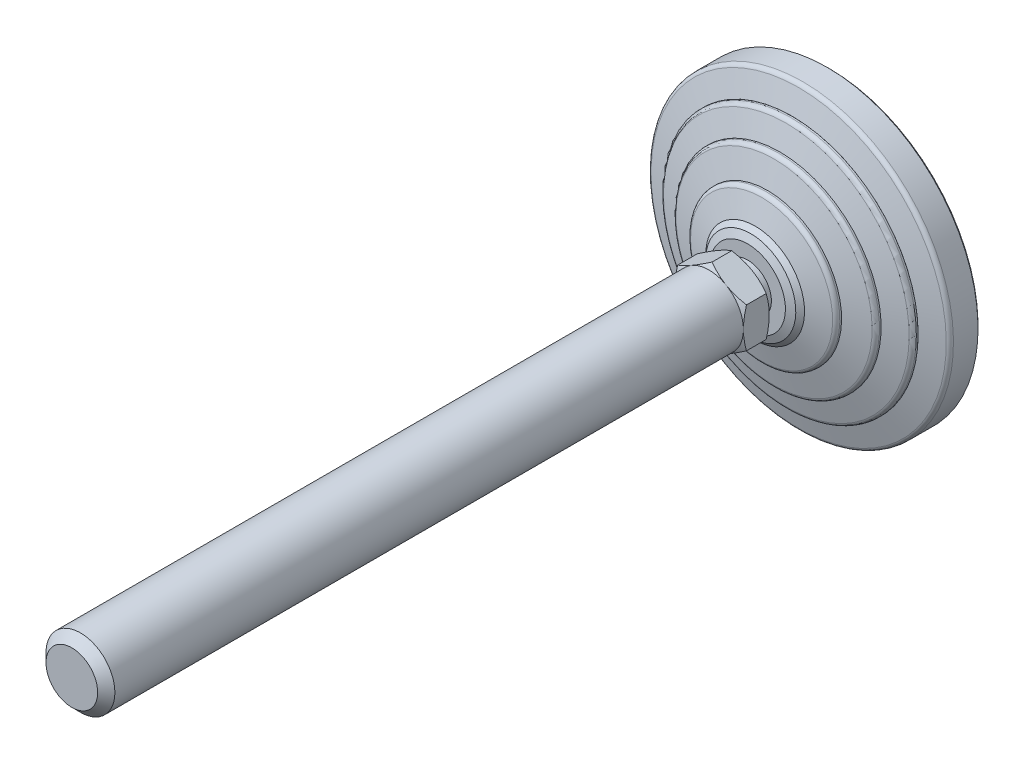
ISO-10303-21;
HEADER;
FILE_DESCRIPTION(('STEP AP214'),'2;1');
FILE_NAME('part.step','',(''),(''),'','','');
FILE_SCHEMA(('AUTOMOTIVE_DESIGN { 1 0 10303 214 1 1 1 1 }'));
ENDSEC;
DATA;
#1=APPLICATION_CONTEXT('core data for automotive mechanical design processes');
#2=APPLICATION_PROTOCOL_DEFINITION('international standard','automotive_design',2000,#1);
#3=PRODUCT_CONTEXT('',#1,'mechanical');
#4=PRODUCT('Part','Part','',(#3));
#5=PRODUCT_RELATED_PRODUCT_CATEGORY('part','',(#4));
#6=PRODUCT_DEFINITION_FORMATION('','',#4);
#7=PRODUCT_DEFINITION_CONTEXT('part definition',#1,'design');
#8=PRODUCT_DEFINITION('design','',#6,#7);
#9=PRODUCT_DEFINITION_SHAPE('','',#8);
#10=(LENGTH_UNIT() NAMED_UNIT(*) SI_UNIT(.MILLI.,.METRE.));
#11=(NAMED_UNIT(*) PLANE_ANGLE_UNIT() SI_UNIT($,.RADIAN.));
#12=(NAMED_UNIT(*) SI_UNIT($,.STERADIAN.) SOLID_ANGLE_UNIT());
#13=UNCERTAINTY_MEASURE_WITH_UNIT(LENGTH_MEASURE(1.E-05),#10,'distance_accuracy_value','');
#14=(GEOMETRIC_REPRESENTATION_CONTEXT(3) GLOBAL_UNCERTAINTY_ASSIGNED_CONTEXT((#13)) GLOBAL_UNIT_ASSIGNED_CONTEXT((#10,
#11,#12)) REPRESENTATION_CONTEXT('',''));
#15=CARTESIAN_POINT('',(0.,0.,0.));
#16=DIRECTION('',(0.,0.,1.));
#17=DIRECTION('',(1.,0.,0.));
#18=AXIS2_PLACEMENT_3D('',#15,#16,#17);
#19=CARTESIAN_POINT('',(0.,0.,0.));
#20=DIRECTION('',(0.,0.,-1.));
#21=DIRECTION('',(0.,1.,0.));
#22=AXIS2_PLACEMENT_3D('',#19,#20,#21);
#23=CYLINDRICAL_SURFACE('',#22,8.00000000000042);
#24=CARTESIAN_POINT('',(0.,0.,174.));
#25=DIRECTION('',(0.,0.,1.));
#26=DIRECTION('',(1.,0.,0.));
#27=AXIS2_PLACEMENT_3D('',#24,#25,#26);
#28=CIRCLE('',#27,8.00000000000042);
#29=CARTESIAN_POINT('',(8.00000000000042,0.,174.));
#30=VERTEX_POINT('',#29);
#31=EDGE_CURVE('E9',#30,#30,#28,.F.);
#32=ORIENTED_EDGE('',*,*,#31,.T.);
#33=EDGE_LOOP('',(#32));
#34=FACE_BOUND('',#33,.T.);
#35=CARTESIAN_POINT('',(0.,0.,28.));
#36=DIRECTION('',(0.,0.,-1.));
#37=DIRECTION('',(0.,1.,0.));
#38=AXIS2_PLACEMENT_3D('',#35,#36,#37);
#39=CIRCLE('',#38,8.00000000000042);
#40=CARTESIAN_POINT('',(4.,6.92820323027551,28.));
#41=VERTEX_POINT('',#40);
#42=CARTESIAN_POINT('',(8.00000000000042,0.,28.));
#43=VERTEX_POINT('',#42);
#44=EDGE_CURVE('E323',#41,#43,#39,.T.);
#45=ORIENTED_EDGE('',*,*,#44,.F.);
#46=CARTESIAN_POINT('',(-4.00000000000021,6.92820323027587,28.));
#47=VERTEX_POINT('',#46);
#48=EDGE_CURVE('E326',#47,#41,#39,.T.);
#49=ORIENTED_EDGE('',*,*,#48,.F.);
#50=CARTESIAN_POINT('',(0.,0.,28.));
#51=DIRECTION('',(0.,0.,-1.));
#52=DIRECTION('',(-1.,0.,0.));
#53=AXIS2_PLACEMENT_3D('',#50,#51,#52);
#54=CIRCLE('',#53,8.00000000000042);
#55=CARTESIAN_POINT('',(-8.00000000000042,0.,28.));
#56=VERTEX_POINT('',#55);
#57=EDGE_CURVE('E349',#56,#47,#54,.T.);
#58=ORIENTED_EDGE('',*,*,#57,.F.);
#59=CARTESIAN_POINT('',(-4.00000000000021,-6.92820323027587,28.));
#60=VERTEX_POINT('',#59);
#61=EDGE_CURVE('E340',#60,#56,#39,.T.);
#62=ORIENTED_EDGE('',*,*,#61,.F.);
#63=CARTESIAN_POINT('',(4.00000000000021,-6.92820323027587,28.));
#64=VERTEX_POINT('',#63);
#65=EDGE_CURVE('E744',#64,#60,#39,.T.);
#66=ORIENTED_EDGE('',*,*,#65,.F.);
#67=EDGE_CURVE('E330',#43,#64,#39,.T.);
#68=ORIENTED_EDGE('',*,*,#67,.F.);
#69=EDGE_LOOP('',(#45,#49,#58,#62,#66,#68));
#70=FACE_BOUND('',#69,.T.);
#71=ADVANCED_FACE('F14',(#34,#70),#23,.T.);
#72=CARTESIAN_POINT('',(-7.76470588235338,0.,21.9999999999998));
#73=DIRECTION('',(0.,0.,1.));
#74=DIRECTION('',(0.,-1.,0.));
#75=AXIS2_PLACEMENT_3D('',#72,#73,#74);
#76=PLANE('',#75);
#77=CARTESIAN_POINT('',(0.,0.,21.9999999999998));
#78=DIRECTION('',(0.,0.,-1.));
#79=DIRECTION('',(0.,1.,0.));
#80=AXIS2_PLACEMENT_3D('',#77,#78,#79);
#81=CIRCLE('',#80,5.50000000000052);
#82=CARTESIAN_POINT('',(0.,5.50000000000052,21.9999999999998));
#83=VERTEX_POINT('',#82);
#84=EDGE_CURVE('E341',#83,#83,#81,.T.);
#85=ORIENTED_EDGE('',*,*,#84,.F.);
#86=EDGE_LOOP('',(#85));
#87=FACE_BOUND('',#86,.T.);
#88=CARTESIAN_POINT('',(0.,0.,21.9999999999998));
#89=DIRECTION('',(0.,0.,-1.));
#90=DIRECTION('',(-1.,0.,0.));
#91=AXIS2_PLACEMENT_3D('',#88,#89,#90);
#92=CIRCLE('',#91,8.00000000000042);
#93=CARTESIAN_POINT('',(4.,6.92820323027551,21.9999999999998));
#94=VERTEX_POINT('',#93);
#95=CARTESIAN_POINT('',(8.,0.,21.9999999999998));
#96=VERTEX_POINT('',#95);
#97=EDGE_CURVE('E730',#94,#96,#92,.T.);
#98=ORIENTED_EDGE('',*,*,#97,.T.);
#99=CARTESIAN_POINT('',(4.,-6.92820323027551,21.9999999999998));
#100=VERTEX_POINT('',#99);
#101=EDGE_CURVE('E137',#96,#100,#92,.T.);
#102=ORIENTED_EDGE('',*,*,#101,.T.);
#103=CARTESIAN_POINT('',(-4.,-6.92820323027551,21.9999999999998));
#104=VERTEX_POINT('',#103);
#105=EDGE_CURVE('E136',#100,#104,#92,.T.);
#106=ORIENTED_EDGE('',*,*,#105,.T.);
#107=CARTESIAN_POINT('',(-8.,0.,21.9999999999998));
#108=VERTEX_POINT('',#107);
#109=EDGE_CURVE('E113',#104,#108,#92,.T.);
#110=ORIENTED_EDGE('',*,*,#109,.T.);
#111=CARTESIAN_POINT('',(-4.,6.92820323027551,21.9999999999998));
#112=VERTEX_POINT('',#111);
#113=EDGE_CURVE('E101',#108,#112,#92,.T.);
#114=ORIENTED_EDGE('',*,*,#113,.T.);
#115=EDGE_CURVE('E29',#112,#94,#92,.T.);
#116=ORIENTED_EDGE('',*,*,#115,.T.);
#117=EDGE_LOOP('',(#98,#102,#106,#110,#114,#116));
#118=FACE_BOUND('',#117,.T.);
#119=ADVANCED_FACE('F134',(#87,#118),#76,.F.);
#120=CARTESIAN_POINT('',(0.,0.,0.));
#121=DIRECTION('',(0.,0.,-1.));
#122=DIRECTION('',(0.,1.,0.));
#123=AXIS2_PLACEMENT_3D('',#120,#121,#122);
#124=CYLINDRICAL_SURFACE('',#123,5.50000000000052);
#125=CARTESIAN_POINT('',(0.,0.,19.));
#126=DIRECTION('',(0.,0.,-1.));
#127=DIRECTION('',(0.,1.,0.));
#128=AXIS2_PLACEMENT_3D('',#125,#126,#127);
#129=CIRCLE('',#128,5.50000000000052);
#130=CARTESIAN_POINT('',(0.,5.50000000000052,19.));
#131=VERTEX_POINT('',#130);
#132=EDGE_CURVE('E443',#131,#131,#129,.T.);
#133=ORIENTED_EDGE('',*,*,#132,.F.);
#134=EDGE_LOOP('',(#133));
#135=FACE_BOUND('',#134,.T.);
#136=ORIENTED_EDGE('',*,*,#84,.T.);
#137=EDGE_LOOP('',(#136));
#138=FACE_BOUND('',#137,.T.);
#139=ADVANCED_FACE('F306',(#135,#138),#124,.T.);
#140=CARTESIAN_POINT('',(-8.7540983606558,0.,19.));
#141=DIRECTION('',(0.,0.,-1.));
#142=DIRECTION('',(0.,1.,0.));
#143=AXIS2_PLACEMENT_3D('',#140,#141,#142);
#144=PLANE('',#143);
#145=CARTESIAN_POINT('',(0.,0.,19.));
#146=DIRECTION('',(0.,0.,-1.));
#147=DIRECTION('',(0.,1.,0.));
#148=AXIS2_PLACEMENT_3D('',#145,#146,#147);
#149=CIRCLE('',#148,8.7540983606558);
#150=CARTESIAN_POINT('',(0.,8.7540983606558,19.));
#151=VERTEX_POINT('',#150);
#152=EDGE_CURVE('E440',#151,#151,#149,.T.);
#153=ORIENTED_EDGE('',*,*,#152,.F.);
#154=EDGE_LOOP('',(#153));
#155=FACE_BOUND('',#154,.T.);
#156=ORIENTED_EDGE('',*,*,#132,.T.);
#157=EDGE_LOOP('',(#156));
#158=FACE_BOUND('',#157,.T.);
#159=ADVANCED_FACE('F302',(#155,#158),#144,.F.);
#160=CARTESIAN_POINT('',(0.,0.,19.));
#161=DIRECTION('',(0.,0.,-1.));
#162=DIRECTION('',(0.,1.,0.));
#163=AXIS2_PLACEMENT_3D('',#160,#161,#162);
#164=CONICAL_SURFACE('',#163,8.7540983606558,1.17809724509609);
#165=CARTESIAN_POINT('',(0.,0.,18.2928932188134));
#166=DIRECTION('',(0.,0.,-1.));
#167=DIRECTION('',(0.,1.,0.));
#168=AXIS2_PLACEMENT_3D('',#165,#166,#167);
#169=CIRCLE('',#168,10.4612051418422);
#170=CARTESIAN_POINT('',(0.,10.4612051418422,18.2928932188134));
#171=VERTEX_POINT('',#170);
#172=EDGE_CURVE('E437',#171,#171,#169,.T.);
#173=ORIENTED_EDGE('',*,*,#172,.F.);
#174=EDGE_LOOP('',(#173));
#175=FACE_BOUND('',#174,.T.);
#176=ORIENTED_EDGE('',*,*,#152,.T.);
#177=EDGE_LOOP('',(#176));
#178=FACE_BOUND('',#177,.T.);
#179=ADVANCED_FACE('F298',(#175,#178),#164,.T.);
#180=CARTESIAN_POINT('',(0.,0.,18.2928932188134));
#181=DIRECTION('',(0.,0.,-1.));
#182=DIRECTION('',(0.,1.,0.));
#183=AXIS2_PLACEMENT_3D('',#180,#181,#182);
#184=CONICAL_SURFACE('',#183,10.4612051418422,0.785398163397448);
#185=CARTESIAN_POINT('',(0.,0.,17.27868852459));
#186=DIRECTION('',(0.,0.,-1.));
#187=DIRECTION('',(0.,1.,0.));
#188=AXIS2_PLACEMENT_3D('',#185,#186,#187);
#189=CIRCLE('',#188,11.4754098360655);
#190=CARTESIAN_POINT('',(0.,11.4754098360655,17.27868852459));
#191=VERTEX_POINT('',#190);
#192=EDGE_CURVE('E434',#191,#191,#189,.T.);
#193=ORIENTED_EDGE('',*,*,#192,.F.);
#194=EDGE_LOOP('',(#193));
#195=FACE_BOUND('',#194,.T.);
#196=ORIENTED_EDGE('',*,*,#172,.T.);
#197=EDGE_LOOP('',(#196));
#198=FACE_BOUND('',#197,.T.);
#199=ADVANCED_FACE('F294',(#195,#198),#184,.T.);
#200=CARTESIAN_POINT('',(0.,0.,17.27868852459));
#201=DIRECTION('',(0.,0.,-1.));
#202=DIRECTION('',(0.,1.,0.));
#203=AXIS2_PLACEMENT_3D('',#200,#201,#202);
#204=CONICAL_SURFACE('',#203,11.4754098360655,1.27933953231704);
#205=CARTESIAN_POINT('',(0.,0.,15.7711726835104));
#206=DIRECTION('',(0.,0.,-1.));
#207=DIRECTION('',(0.,1.,0.));
#208=AXIS2_PLACEMENT_3D('',#205,#206,#207);
#209=CIRCLE('',#208,16.5004626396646);
#210=CARTESIAN_POINT('',(0.,16.5004626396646,15.7711726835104));
#211=VERTEX_POINT('',#210);
#212=EDGE_CURVE('E431',#211,#211,#209,.T.);
#213=ORIENTED_EDGE('',*,*,#212,.F.);
#214=EDGE_LOOP('',(#213));
#215=FACE_BOUND('',#214,.T.);
#216=ORIENTED_EDGE('',*,*,#192,.T.);
#217=EDGE_LOOP('',(#216));
#218=FACE_BOUND('',#217,.T.);
#219=ADVANCED_FACE('F290',(#215,#218),#204,.T.);
#220=CARTESIAN_POINT('',(0.,0.,14.8133463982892));
#221=DIRECTION('',(0.,0.,-1.));
#222=DIRECTION('',(0.,1.,0.));
#223=AXIS2_PLACEMENT_3D('',#220,#221,#222);
#224=TOROIDAL_SURFACE('',#223,16.2131147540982,1.);
#225=CARTESIAN_POINT('',(0.,0.,14.8133463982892));
#226=DIRECTION('',(0.,0.,-1.));
#227=DIRECTION('',(0.,1.,0.));
#228=AXIS2_PLACEMENT_3D('',#225,#226,#227);
#229=CIRCLE('',#228,17.2131147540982);
#230=CARTESIAN_POINT('',(0.,17.2131147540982,14.8133463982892));
#231=VERTEX_POINT('',#230);
#232=EDGE_CURVE('E428',#231,#231,#229,.T.);
#233=ORIENTED_EDGE('',*,*,#232,.F.);
#234=EDGE_LOOP('',(#233));
#235=FACE_BOUND('',#234,.T.);
#236=ORIENTED_EDGE('',*,*,#212,.T.);
#237=EDGE_LOOP('',(#236));
#238=FACE_BOUND('',#237,.T.);
#239=ADVANCED_FACE('F286',(#235,#238),#224,.T.);
#240=CARTESIAN_POINT('',(0.,0.,0.));
#241=DIRECTION('',(0.,0.,-1.));
#242=DIRECTION('',(0.,1.,0.));
#243=AXIS2_PLACEMENT_3D('',#240,#241,#242);
#244=CYLINDRICAL_SURFACE('',#243,17.2131147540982);
#245=CARTESIAN_POINT('',(0.,0.,14.4098360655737));
#246=DIRECTION('',(0.,0.,-1.));
#247=DIRECTION('',(0.,1.,0.));
#248=AXIS2_PLACEMENT_3D('',#245,#246,#247);
#249=CIRCLE('',#248,17.2131147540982);
#250=CARTESIAN_POINT('',(0.,17.2131147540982,14.4098360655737));
#251=VERTEX_POINT('',#250);
#252=EDGE_CURVE('E425',#251,#251,#249,.T.);
#253=ORIENTED_EDGE('',*,*,#252,.F.);
#254=EDGE_LOOP('',(#253));
#255=FACE_BOUND('',#254,.T.);
#256=ORIENTED_EDGE('',*,*,#232,.T.);
#257=EDGE_LOOP('',(#256));
#258=FACE_BOUND('',#257,.T.);
#259=ADVANCED_FACE('F282',(#255,#258),#244,.T.);
#260=CARTESIAN_POINT('',(0.,0.,14.4098360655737));
#261=DIRECTION('',(0.,0.,-1.));
#262=DIRECTION('',(0.,1.,0.));
#263=AXIS2_PLACEMENT_3D('',#260,#261,#262);
#264=CONICAL_SURFACE('',#263,17.2131147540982,1.30454427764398);
#265=CARTESIAN_POINT('',(0.,0.,12.8894925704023));
#266=DIRECTION('',(0.,0.,-1.));
#267=DIRECTION('',(0.,1.,0.));
#268=AXIS2_PLACEMENT_3D('',#265,#266,#267);
#269=CIRCLE('',#268,22.7877075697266);
#270=CARTESIAN_POINT('',(0.,22.7877075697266,12.8894925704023));
#271=VERTEX_POINT('',#270);
#272=EDGE_CURVE('E422',#271,#271,#269,.T.);
#273=ORIENTED_EDGE('',*,*,#272,.F.);
#274=EDGE_LOOP('',(#273));
#275=FACE_BOUND('',#274,.T.);
#276=ORIENTED_EDGE('',*,*,#252,.T.);
#277=EDGE_LOOP('',(#276));
#278=FACE_BOUND('',#277,.T.);
#279=ADVANCED_FACE('F278',(#275,#278),#264,.T.);
#280=CARTESIAN_POINT('',(0.,0.,11.9247287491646));
#281=DIRECTION('',(0.,0.,-1.));
#282=DIRECTION('',(0.,1.,0.));
#283=AXIS2_PLACEMENT_3D('',#280,#281,#282);
#284=TOROIDAL_SURFACE('',#283,22.5245901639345,1.);
#285=CARTESIAN_POINT('',(0.,0.,11.9247287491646));
#286=DIRECTION('',(0.,0.,-1.));
#287=DIRECTION('',(0.,1.,0.));
#288=AXIS2_PLACEMENT_3D('',#285,#286,#287);
#289=CIRCLE('',#288,23.5245901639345);
#290=CARTESIAN_POINT('',(0.,23.5245901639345,11.9247287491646));
#291=VERTEX_POINT('',#290);
#292=EDGE_CURVE('E419',#291,#291,#289,.T.);
#293=ORIENTED_EDGE('',*,*,#292,.F.);
#294=EDGE_LOOP('',(#293));
#295=FACE_BOUND('',#294,.T.);
#296=ORIENTED_EDGE('',*,*,#272,.T.);
#297=EDGE_LOOP('',(#296));
#298=FACE_BOUND('',#297,.T.);
#299=ADVANCED_FACE('F274',(#295,#298),#284,.T.);
#300=CARTESIAN_POINT('',(0.,0.,0.));
#301=DIRECTION('',(0.,0.,-1.));
#302=DIRECTION('',(0.,1.,0.));
#303=AXIS2_PLACEMENT_3D('',#300,#301,#302);
#304=CYLINDRICAL_SURFACE('',#303,23.5245901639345);
#305=CARTESIAN_POINT('',(0.,0.,11.5409836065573));
#306=DIRECTION('',(0.,0.,-1.));
#307=DIRECTION('',(0.,1.,0.));
#308=AXIS2_PLACEMENT_3D('',#305,#306,#307);
#309=CIRCLE('',#308,23.5245901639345);
#310=CARTESIAN_POINT('',(0.,23.5245901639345,11.5409836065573));
#311=VERTEX_POINT('',#310);
#312=EDGE_CURVE('E416',#311,#311,#309,.T.);
#313=ORIENTED_EDGE('',*,*,#312,.F.);
#314=EDGE_LOOP('',(#313));
#315=FACE_BOUND('',#314,.T.);
#316=ORIENTED_EDGE('',*,*,#292,.T.);
#317=EDGE_LOOP('',(#316));
#318=FACE_BOUND('',#317,.T.);
#319=ADVANCED_FACE('F270',(#315,#318),#304,.T.);
#320=CARTESIAN_POINT('',(0.,0.,11.5409836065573));
#321=DIRECTION('',(0.,0.,-1.));
#322=DIRECTION('',(0.,1.,0.));
#323=AXIS2_PLACEMENT_3D('',#320,#321,#322);
#324=CONICAL_SURFACE('',#323,23.5245901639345,1.27871257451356);
#325=CARTESIAN_POINT('',(0.,0.,10.0337743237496));
#326=DIRECTION('',(0.,0.,-1.));
#327=DIRECTION('',(0.,1.,0.));
#328=AXIS2_PLACEMENT_3D('',#325,#326,#327);
#329=CIRCLE('',#328,28.5372004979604);
#330=CARTESIAN_POINT('',(0.,28.5372004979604,10.0337743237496));
#331=VERTEX_POINT('',#330);
#332=EDGE_CURVE('E413',#331,#331,#329,.T.);
#333=ORIENTED_EDGE('',*,*,#332,.F.);
#334=EDGE_LOOP('',(#333));
#335=FACE_BOUND('',#334,.T.);
#336=ORIENTED_EDGE('',*,*,#312,.T.);
#337=EDGE_LOOP('',(#336));
#338=FACE_BOUND('',#337,.T.);
#339=ADVANCED_FACE('F266',(#335,#338),#324,.T.);
#340=CARTESIAN_POINT('',(0.,0.,9.07612838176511));
#341=DIRECTION('',(0.,0.,-1.));
#342=DIRECTION('',(0.,1.,0.));
#343=AXIS2_PLACEMENT_3D('',#340,#341,#342);
#344=TOROIDAL_SURFACE('',#343,28.2492521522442,1.);
#345=CARTESIAN_POINT('',(0.,0.,9.07612838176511));
#346=DIRECTION('',(0.,0.,-1.));
#347=DIRECTION('',(0.,1.,0.));
#348=AXIS2_PLACEMENT_3D('',#345,#346,#347);
#349=CIRCLE('',#348,29.2492521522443);
#350=CARTESIAN_POINT('',(0.,29.2492521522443,9.07612838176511));
#351=VERTEX_POINT('',#350);
#352=EDGE_CURVE('E410',#351,#351,#349,.T.);
#353=ORIENTED_EDGE('',*,*,#352,.F.);
#354=EDGE_LOOP('',(#353));
#355=FACE_BOUND('',#354,.T.);
#356=ORIENTED_EDGE('',*,*,#332,.T.);
#357=EDGE_LOOP('',(#356));
#358=FACE_BOUND('',#357,.T.);
#359=ADVANCED_FACE('F262',(#355,#358),#344,.T.);
#360=CARTESIAN_POINT('',(0.,0.,0.));
#361=DIRECTION('',(0.,0.,-1.));
#362=DIRECTION('',(0.,1.,0.));
#363=AXIS2_PLACEMENT_3D('',#360,#361,#362);
#364=CYLINDRICAL_SURFACE('',#363,29.2492521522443);
#365=CARTESIAN_POINT('',(0.,0.,8.67213114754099));
#366=DIRECTION('',(0.,0.,-1.));
#367=DIRECTION('',(0.,1.,0.));
#368=AXIS2_PLACEMENT_3D('',#365,#366,#367);
#369=CIRCLE('',#368,29.2492521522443);
#370=CARTESIAN_POINT('',(0.,29.2492521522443,8.67213114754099));
#371=VERTEX_POINT('',#370);
#372=EDGE_CURVE('E407',#371,#371,#369,.T.);
#373=ORIENTED_EDGE('',*,*,#372,.F.);
#374=EDGE_LOOP('',(#373));
#375=FACE_BOUND('',#374,.T.);
#376=ORIENTED_EDGE('',*,*,#352,.T.);
#377=EDGE_LOOP('',(#376));
#378=FACE_BOUND('',#377,.T.);
#379=ADVANCED_FACE('F258',(#375,#378),#364,.T.);
#380=CARTESIAN_POINT('',(-29.2622950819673,0.,8.67213114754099));
#381=DIRECTION('',(0.,0.,-1.));
#382=DIRECTION('',(0.,1.,0.));
#383=AXIS2_PLACEMENT_3D('',#380,#381,#382);
#384=PLANE('',#383);
#385=CARTESIAN_POINT('',(0.,0.,8.67213114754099));
#386=DIRECTION('',(0.,0.,-1.));
#387=DIRECTION('',(0.,1.,0.));
#388=AXIS2_PLACEMENT_3D('',#385,#386,#387);
#389=CIRCLE('',#388,29.2622950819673);
#390=CARTESIAN_POINT('',(0.,29.2622950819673,8.67213114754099));
#391=VERTEX_POINT('',#390);
#392=EDGE_CURVE('E404',#391,#391,#389,.T.);
#393=ORIENTED_EDGE('',*,*,#392,.F.);
#394=EDGE_LOOP('',(#393));
#395=FACE_BOUND('',#394,.T.);
#396=ORIENTED_EDGE('',*,*,#372,.T.);
#397=EDGE_LOOP('',(#396));
#398=FACE_BOUND('',#397,.T.);
#399=ADVANCED_FACE('F254',(#395,#398),#384,.F.);
#400=CARTESIAN_POINT('',(0.,0.,8.67213114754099));
#401=DIRECTION('',(0.,0.,-1.));
#402=DIRECTION('',(0.,1.,0.));
#403=AXIS2_PLACEMENT_3D('',#400,#401,#402);
#404=CONICAL_SURFACE('',#403,29.2622950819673,1.27933953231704);
#405=CARTESIAN_POINT('',(0.,0.,7.16461530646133));
#406=DIRECTION('',(0.,0.,-1.));
#407=DIRECTION('',(0.,1.,0.));
#408=AXIS2_PLACEMENT_3D('',#405,#406,#407);
#409=CIRCLE('',#408,34.2873478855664);
#410=CARTESIAN_POINT('',(0.,34.2873478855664,7.16461530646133));
#411=VERTEX_POINT('',#410);
#412=EDGE_CURVE('E401',#411,#411,#409,.T.);
#413=ORIENTED_EDGE('',*,*,#412,.F.);
#414=EDGE_LOOP('',(#413));
#415=FACE_BOUND('',#414,.T.);
#416=ORIENTED_EDGE('',*,*,#392,.T.);
#417=EDGE_LOOP('',(#416));
#418=FACE_BOUND('',#417,.T.);
#419=ADVANCED_FACE('F250',(#415,#418),#404,.T.);
#420=CARTESIAN_POINT('',(0.,0.,6.20678902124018));
#421=DIRECTION('',(0.,0.,-1.));
#422=DIRECTION('',(0.,1.,0.));
#423=AXIS2_PLACEMENT_3D('',#420,#421,#422);
#424=TOROIDAL_SURFACE('',#423,34.,1.);
#425=CARTESIAN_POINT('',(0.,0.,6.20678902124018));
#426=DIRECTION('',(0.,0.,-1.));
#427=DIRECTION('',(0.,1.,0.));
#428=AXIS2_PLACEMENT_3D('',#425,#426,#427);
#429=CIRCLE('',#428,35.);
#430=CARTESIAN_POINT('',(0.,35.,6.20678902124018));
#431=VERTEX_POINT('',#430);
#432=EDGE_CURVE('E398',#431,#431,#429,.T.);
#433=ORIENTED_EDGE('',*,*,#432,.F.);
#434=EDGE_LOOP('',(#433));
#435=FACE_BOUND('',#434,.T.);
#436=ORIENTED_EDGE('',*,*,#412,.T.);
#437=EDGE_LOOP('',(#436));
#438=FACE_BOUND('',#437,.T.);
#439=ADVANCED_FACE('F246',(#435,#438),#424,.T.);
#440=CARTESIAN_POINT('',(0.,0.,0.));
#441=DIRECTION('',(0.,0.,-1.));
#442=DIRECTION('',(0.,1.,0.));
#443=AXIS2_PLACEMENT_3D('',#440,#441,#442);
#444=CYLINDRICAL_SURFACE('',#443,35.);
#445=CARTESIAN_POINT('',(0.,0.,0.5));
#446=DIRECTION('',(0.,0.,-1.));
#447=DIRECTION('',(0.,1.,0.));
#448=AXIS2_PLACEMENT_3D('',#445,#446,#447);
#449=CIRCLE('',#448,35.);
#450=CARTESIAN_POINT('',(0.,35.,0.5));
#451=VERTEX_POINT('',#450);
#452=EDGE_CURVE('E395',#451,#451,#449,.T.);
#453=ORIENTED_EDGE('',*,*,#452,.F.);
#454=EDGE_LOOP('',(#453));
#455=FACE_BOUND('',#454,.T.);
#456=ORIENTED_EDGE('',*,*,#432,.T.);
#457=EDGE_LOOP('',(#456));
#458=FACE_BOUND('',#457,.T.);
#459=ADVANCED_FACE('F242',(#455,#458),#444,.T.);
#460=CARTESIAN_POINT('',(0.,0.,0.5));
#461=DIRECTION('',(0.,0.,1.));
#462=DIRECTION('',(0.,-1.,0.));
#463=AXIS2_PLACEMENT_3D('',#460,#461,#462);
#464=CONICAL_SURFACE('',#463,35.,0.785398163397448);
#465=CARTESIAN_POINT('',(0.,0.,0.));
#466=DIRECTION('',(0.,0.,-1.));
#467=DIRECTION('',(0.,1.,0.));
#468=AXIS2_PLACEMENT_3D('',#465,#466,#467);
#469=CIRCLE('',#468,34.5);
#470=CARTESIAN_POINT('',(0.,34.5,0.));
#471=VERTEX_POINT('',#470);
#472=EDGE_CURVE('E392',#471,#471,#469,.T.);
#473=ORIENTED_EDGE('',*,*,#472,.F.);
#474=EDGE_LOOP('',(#473));
#475=FACE_BOUND('',#474,.T.);
#476=ORIENTED_EDGE('',*,*,#452,.T.);
#477=EDGE_LOOP('',(#476));
#478=FACE_BOUND('',#477,.T.);
#479=ADVANCED_FACE('F238',(#475,#478),#464,.T.);
#480=CARTESIAN_POINT('',(-34.5,0.,0.));
#481=DIRECTION('',(0.,0.,1.));
#482=DIRECTION('',(0.,-1.,0.));
#483=AXIS2_PLACEMENT_3D('',#480,#481,#482);
#484=PLANE('',#483);
#485=ORIENTED_EDGE('',*,*,#472,.T.);
#486=EDGE_LOOP('',(#485));
#487=FACE_BOUND('',#486,.T.);
#488=ADVANCED_FACE('F234',(#487),#484,.F.);
#489=CARTESIAN_POINT('',(0.,0.,23.6725795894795));
#490=DIRECTION('',(0.,0.,1.));
#491=DIRECTION('',(1.,0.,0.));
#492=AXIS2_PLACEMENT_3D('',#489,#490,#491);
#493=CONICAL_SURFACE('',#492,10.8969928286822,1.0471975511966);
#494=CARTESIAN_POINT('',(8.,-12.3831271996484,25.8927946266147));
#495=CARTESIAN_POINT('',(8.,-12.0339178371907,25.7234915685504));
#496=CARTESIAN_POINT('',(8.,-11.6839043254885,25.5558186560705));
#497=CARTESIAN_POINT('',(8.,-10.9818412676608,25.2246504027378));
#498=CARTESIAN_POINT('',(8.,-10.6297914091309,25.0611557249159));
#499=CARTESIAN_POINT('',(8.,-9.92140267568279,24.7384336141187));
#500=CARTESIAN_POINT('',(8.,-9.56505086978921,24.5792344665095));
#501=CARTESIAN_POINT('',(8.,-8.84950484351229,24.2673824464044));
#502=CARTESIAN_POINT('',(8.,-8.49031075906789,24.1147292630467));
#503=CARTESIAN_POINT('',(8.,-7.75699194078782,23.8129588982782));
#504=CARTESIAN_POINT('',(8.,-7.3827563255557,23.6641096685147));
#505=CARTESIAN_POINT('',(8.,-6.62989896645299,23.3777337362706));
#506=CARTESIAN_POINT('',(8.,-6.2512767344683,23.2402083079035));
#507=CARTESIAN_POINT('',(8.,-5.48975556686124,22.9801080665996));
#508=CARTESIAN_POINT('',(8.,-5.10686715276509,22.8575027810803));
#509=CARTESIAN_POINT('',(8.,-4.33561184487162,22.6311909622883));
#510=CARTESIAN_POINT('',(8.,-3.94724672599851,22.527478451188));
#511=CARTESIAN_POINT('',(8.,-3.16691133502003,22.3445040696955));
#512=CARTESIAN_POINT('',(8.,-2.77497291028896,22.2651100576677));
#513=CARTESIAN_POINT('',(8.,-2.18351497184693,22.1677051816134));
#514=CARTESIAN_POINT('',(8.,-1.98575586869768,22.138849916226));
#515=CARTESIAN_POINT('',(8.,-1.58926272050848,22.088934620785));
#516=CARTESIAN_POINT('',(8.,-1.39052877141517,22.0678738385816));
#517=CARTESIAN_POINT('',(8.,-0.994937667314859,22.0342299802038));
#518=CARTESIAN_POINT('',(8.,-0.798089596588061,22.0215405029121));
#519=CARTESIAN_POINT('',(8.,-0.404033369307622,22.0044955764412));
#520=CARTESIAN_POINT('',(8.,-0.20682521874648,22.0001399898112));
#521=CARTESIAN_POINT('',(8.,0.187598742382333,21.999866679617));
#522=CARTESIAN_POINT('',(8.,0.384814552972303,22.003948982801));
#523=CARTESIAN_POINT('',(8.,0.778899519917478,22.0204520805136));
#524=CARTESIAN_POINT('',(8.,0.975768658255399,22.0328732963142));
#525=CARTESIAN_POINT('',(8.,1.44963287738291,22.0725452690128));
#526=CARTESIAN_POINT('',(8.,1.72630031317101,22.1037929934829));
#527=CARTESIAN_POINT('',(8.,2.27755314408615,22.1810471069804));
#528=CARTESIAN_POINT('',(8.,2.55213824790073,22.2270555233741));
#529=CARTESIAN_POINT('',(8.,3.37247312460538,22.384779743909));
#530=CARTESIAN_POINT('',(8.,3.91448954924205,22.5161648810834));
#531=CARTESIAN_POINT('',(8.,4.72489146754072,22.743634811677));
#532=CARTESIAN_POINT('',(8.,4.99749005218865,22.8255700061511));
#533=CARTESIAN_POINT('',(8.,5.54003906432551,22.9978612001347));
#534=CARTESIAN_POINT('',(8.,5.80998947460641,23.0882172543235));
#535=CARTESIAN_POINT('',(8.,6.34732850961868,23.2759079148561));
#536=CARTESIAN_POINT('',(8.,6.6147179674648,23.3732401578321));
#537=CARTESIAN_POINT('',(8.,7.14728780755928,23.5737469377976));
#538=CARTESIAN_POINT('',(8.,7.41246821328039,23.6769214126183));
#539=CARTESIAN_POINT('',(8.,8.02822522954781,23.9230623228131));
#540=CARTESIAN_POINT('',(8.,8.37804952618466,24.0679070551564));
#541=CARTESIAN_POINT('',(8.,9.0747983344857,24.3644300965));
#542=CARTESIAN_POINT('',(8.,9.42172268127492,24.5161087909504));
#543=CARTESIAN_POINT('',(8.,10.1131908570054,24.8249567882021));
#544=CARTESIAN_POINT('',(8.,10.4577342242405,24.9821271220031));
#545=CARTESIAN_POINT('',(8.,11.1447759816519,25.3008833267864));
#546=CARTESIAN_POINT('',(8.,11.4872743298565,25.4624692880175));
#547=CARTESIAN_POINT('',(8.,12.170894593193,25.7894074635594));
#548=CARTESIAN_POINT('',(8.,12.5120147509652,25.9547633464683));
#549=CARTESIAN_POINT('',(8.,13.1927965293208,26.2884534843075));
#550=CARTESIAN_POINT('',(8.,13.5324581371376,26.4567877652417));
#551=CARTESIAN_POINT('',(8.,14.549511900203,26.9654383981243));
#552=CARTESIAN_POINT('',(8.,15.2250588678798,27.309443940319));
#553=CARTESIAN_POINT('',(8.,16.5176508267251,27.9761006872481));
#554=CARTESIAN_POINT('',(8.,17.1349775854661,28.2982079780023));
#555=CARTESIAN_POINT('',(8.,18.3673152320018,28.9468684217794));
#556=CARTESIAN_POINT('',(8.,18.982326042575,29.2734217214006));
#557=CARTESIAN_POINT('',(8.,20.2090632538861,29.9291389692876));
#558=CARTESIAN_POINT('',(8.,20.8207939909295,30.2582948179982));
#559=CARTESIAN_POINT('',(8.,22.042768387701,30.9192794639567));
#560=CARTESIAN_POINT('',(8.,22.6530121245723,31.2511081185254));
#561=CARTESIAN_POINT('',(8.,23.2627056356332,31.5839378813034));
#562=B_SPLINE_CURVE_WITH_KNOTS('',3,(#494,#495,#496,#497,#498,#499,#500,#501,#502,#503,#504,
#505,#506,#507,#508,#509,#510,#511,#512,#513,#514,#515,#516,#517,#518,#519,#520,#521,#522,#523,
#524,#525,#526,#527,#528,#529,#530,#531,#532,#533,#534,#535,#536,#537,#538,#539,#540,#541,#542,
#543,#544,#545,#546,#547,#548,#549,#550,#551,#552,#553,#554,#555,#556,#557,#558,#559,#560,#561),
.UNSPECIFIED.,.F.,.F.,(4,2,2,2,2,2,2,2,2,2,2,2,2,2,2,2,2,2,2,2,2,2,2,2,2,2,2,2,2,2,2,2,2,4),(0.,
1.16427217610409,2.32872797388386,3.49956327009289,4.67034290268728,5.8784538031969,
7.08670045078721,8.2924364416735,9.49779026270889,10.6964732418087,11.2959033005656,
11.8952755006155,12.4868747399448,13.0784642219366,13.6700555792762,14.2616768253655,
15.0964839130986,15.9314057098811,17.6021880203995,18.4560560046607,19.3099295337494,
20.1635151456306,21.0170916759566,22.152870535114,23.2887135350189,24.4247709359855,
25.5608515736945,26.6980894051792,27.8353371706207,30.1095467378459,32.1984526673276,
34.287427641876,36.3714125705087,38.455286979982),.UNSPECIFIED.);
#563=CARTESIAN_POINT('',(8.,4.61880215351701,22.7145311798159));
#564=VERTEX_POINT('',#563);
#565=EDGE_CURVE('E111',#564,#96,#562,.F.);
#566=ORIENTED_EDGE('',*,*,#565,.T.);
#567=ORIENTED_EDGE('',*,*,#97,.F.);
#568=CARTESIAN_POINT('',(-0.000199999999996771,9.23771977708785,22.7145978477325));
#569=CARTESIAN_POINT('',(0.175648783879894,9.13619343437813,22.6559907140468));
#570=CARTESIAN_POINT('',(0.35215319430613,9.03428856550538,22.6000434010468));
#571=CARTESIAN_POINT('',(0.706595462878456,8.82965122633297,22.4942010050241));
#572=CARTESIAN_POINT('',(0.88453390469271,8.72691841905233,22.4443085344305));
#573=CARTESIAN_POINT('',(1.42119823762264,8.41707512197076,22.3046927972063));
#574=CARTESIAN_POINT('',(1.78204258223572,8.20874154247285,22.2252811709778));
#575=CARTESIAN_POINT('',(2.32203917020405,7.89697436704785,22.132161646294));
#576=CARTESIAN_POINT('',(2.49957818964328,7.79447216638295,22.1056345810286));
#577=CARTESIAN_POINT('',(2.85545911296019,7.58900421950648,22.0611531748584));
#578=CARTESIAN_POINT('',(3.03380094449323,7.4860385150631,22.0431980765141));
#579=CARTESIAN_POINT('',(3.39079168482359,7.27992981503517,22.0163156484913));
#580=CARTESIAN_POINT('',(3.5694400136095,7.17678715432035,22.0073780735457));
#581=CARTESIAN_POINT('',(3.92690170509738,6.97040655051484,21.9987223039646));
#582=CARTESIAN_POINT('',(4.10571506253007,6.86716861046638,21.9990038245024));
#583=CARTESIAN_POINT('',(4.44001336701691,6.67416139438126,22.0081450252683));
#584=CARTESIAN_POINT('',(4.59552190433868,6.58437849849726,22.0158896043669));
#585=CARTESIAN_POINT('',(4.90617476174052,6.40502298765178,22.0382011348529));
#586=CARTESIAN_POINT('',(5.06131905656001,6.31545038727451,22.0527685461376));
#587=CARTESIAN_POINT('',(5.52615131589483,6.04707935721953,22.106360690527));
#588=CARTESIAN_POINT('',(5.83501648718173,5.86875596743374,22.1552686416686));
#589=CARTESIAN_POINT('',(6.45602322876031,5.51021755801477,22.2775394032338));
#590=CARTESIAN_POINT('',(6.76808554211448,5.3300482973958,22.3514205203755));
#591=CARTESIAN_POINT('',(7.38755648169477,4.97239658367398,22.5191001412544));
#592=CARTESIAN_POINT('',(7.69497304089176,4.79490955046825,22.6128592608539));
#593=CARTESIAN_POINT('',(8.0002,4.61868668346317,22.7145978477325));
#594=B_SPLINE_CURVE_WITH_KNOTS('',3,(#568,#569,#570,#571,#572,#573,#574,#575,#576,#577,#578,
#579,#580,#581,#582,#583,#584,#585,#586,#587,#588,#589,#590,#591,#592,#593),.UNSPECIFIED.,.F.,
.F.,(4,2,2,2,2,2,2,2,2,2,2,2,4),(0.,0.633973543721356,1.26821965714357,2.53934712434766,
3.15934343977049,3.77928496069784,4.39852133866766,5.01773858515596,5.5568023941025,
6.0959025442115,7.17487077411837,8.27776850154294,9.37850115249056),.UNSPECIFIED.);
#595=EDGE_CURVE('E334',#94,#564,#594,.T.);
#596=ORIENTED_EDGE('',*,*,#595,.T.);
#597=EDGE_LOOP('',(#566,#567,#596));
#598=FACE_BOUND('',#597,.T.);
#599=ADVANCED_FACE('F155',(#598),#493,.T.);
#600=CARTESIAN_POINT('',(-8.0002,4.61868668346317,22.7145978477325));
#601=CARTESIAN_POINT('',(-7.82435121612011,4.72021302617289,22.6559907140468));
#602=CARTESIAN_POINT('',(-7.64784680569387,4.82211789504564,22.6000434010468));
#603=CARTESIAN_POINT('',(-7.29340453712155,5.02675523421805,22.4942010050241));
#604=CARTESIAN_POINT('',(-7.11546609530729,5.12948804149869,22.4443085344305));
#605=CARTESIAN_POINT('',(-6.57880176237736,5.43933133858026,22.3046927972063));
#606=CARTESIAN_POINT('',(-6.21795741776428,5.64766491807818,22.2252811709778));
#607=CARTESIAN_POINT('',(-5.67796082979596,5.95943209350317,22.132161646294));
#608=CARTESIAN_POINT('',(-5.50042181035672,6.06193429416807,22.1056345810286));
#609=CARTESIAN_POINT('',(-5.14454088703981,6.26740224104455,22.0611531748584));
#610=CARTESIAN_POINT('',(-4.96619905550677,6.37036794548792,22.0431980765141));
#611=CARTESIAN_POINT('',(-4.60920831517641,6.57647664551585,22.0163156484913));
#612=CARTESIAN_POINT('',(-4.4305599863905,6.67961930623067,22.0073780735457));
#613=CARTESIAN_POINT('',(-4.07309829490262,6.88599991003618,21.9987223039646));
#614=CARTESIAN_POINT('',(-3.89428493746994,6.98923785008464,21.9990038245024));
#615=CARTESIAN_POINT('',(-3.5599866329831,7.18224506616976,22.0081450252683));
#616=CARTESIAN_POINT('',(-3.40447809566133,7.27202796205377,22.0158896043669));
#617=CARTESIAN_POINT('',(-3.09382523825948,7.45138347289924,22.0382011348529));
#618=CARTESIAN_POINT('',(-2.93868094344,7.54095607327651,22.0527685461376));
#619=CARTESIAN_POINT('',(-2.47384868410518,7.80932710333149,22.106360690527));
#620=CARTESIAN_POINT('',(-2.16498351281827,7.98765049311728,22.1552686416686));
#621=CARTESIAN_POINT('',(-1.54397677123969,8.34618890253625,22.2775394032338));
#622=CARTESIAN_POINT('',(-1.23191445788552,8.52635816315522,22.3514205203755));
#623=CARTESIAN_POINT('',(-0.612443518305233,8.88400987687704,22.5191001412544));
#624=CARTESIAN_POINT('',(-0.305026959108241,9.06149691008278,22.6128592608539));
#625=CARTESIAN_POINT('',(0.000200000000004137,9.23771977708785,22.7145978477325));
#626=B_SPLINE_CURVE_WITH_KNOTS('',3,(#600,#601,#602,#603,#604,#605,#606,#607,#608,#609,#610,
#611,#612,#613,#614,#615,#616,#617,#618,#619,#620,#621,#622,#623,#624,#625),.UNSPECIFIED.,.F.,
.F.,(4,2,2,2,2,2,2,2,2,2,2,2,4),(0.,0.633973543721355,1.26821965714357,2.53934712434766,
3.15934343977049,3.77928496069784,4.39852133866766,5.01773858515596,5.5568023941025,
6.09590254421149,7.17487077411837,8.27776850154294,9.37850115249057),.UNSPECIFIED.);
#627=CARTESIAN_POINT('',(0.,9.23760430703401,22.7145311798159));
#628=VERTEX_POINT('',#627);
#629=EDGE_CURVE('E147',#112,#628,#626,.T.);
#630=ORIENTED_EDGE('',*,*,#629,.T.);
#631=EDGE_CURVE('E33',#628,#94,#594,.T.);
#632=ORIENTED_EDGE('',*,*,#631,.T.);
#633=ORIENTED_EDGE('',*,*,#115,.F.);
#634=EDGE_LOOP('',(#630,#632,#633));
#635=FACE_BOUND('',#634,.T.);
#636=ADVANCED_FACE('F576',(#635),#493,.T.);
#637=CARTESIAN_POINT('',(8.0002,-4.61868668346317,22.7145978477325));
#638=CARTESIAN_POINT('',(7.82435121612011,-4.72021302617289,22.6559907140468));
#639=CARTESIAN_POINT('',(7.64784680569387,-4.82211789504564,22.6000434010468));
#640=CARTESIAN_POINT('',(7.29340453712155,-5.02675523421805,22.4942010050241));
#641=CARTESIAN_POINT('',(7.11546609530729,-5.12948804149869,22.4443085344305));
#642=CARTESIAN_POINT('',(6.57880176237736,-5.43933133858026,22.3046927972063));
#643=CARTESIAN_POINT('',(6.21795741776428,-5.64766491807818,22.2252811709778));
#644=CARTESIAN_POINT('',(5.67796082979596,-5.95943209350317,22.132161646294));
#645=CARTESIAN_POINT('',(5.50042181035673,-6.06193429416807,22.1056345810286));
#646=CARTESIAN_POINT('',(5.14454088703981,-6.26740224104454,22.0611531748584));
#647=CARTESIAN_POINT('',(4.96619905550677,-6.37036794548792,22.0431980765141));
#648=CARTESIAN_POINT('',(4.60920831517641,-6.57647664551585,22.0163156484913));
#649=CARTESIAN_POINT('',(4.43055998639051,-6.67961930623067,22.0073780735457));
#650=CARTESIAN_POINT('',(4.07309829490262,-6.88599991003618,21.9987223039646));
#651=CARTESIAN_POINT('',(3.89428493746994,-6.98923785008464,21.9990038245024));
#652=CARTESIAN_POINT('',(3.5599866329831,-7.18224506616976,22.0081450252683));
#653=CARTESIAN_POINT('',(3.40447809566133,-7.27202796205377,22.0158896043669));
#654=CARTESIAN_POINT('',(3.09382523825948,-7.45138347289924,22.0382011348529));
#655=CARTESIAN_POINT('',(2.93868094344,-7.54095607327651,22.0527685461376));
#656=CARTESIAN_POINT('',(2.47384868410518,-7.80932710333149,22.106360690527));
#657=CARTESIAN_POINT('',(2.16498351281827,-7.98765049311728,22.1552686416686));
#658=CARTESIAN_POINT('',(1.5439767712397,-8.34618890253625,22.2775394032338));
#659=CARTESIAN_POINT('',(1.23191445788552,-8.52635816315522,22.3514205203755));
#660=CARTESIAN_POINT('',(0.612443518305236,-8.88400987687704,22.5191001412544));
#661=CARTESIAN_POINT('',(0.305026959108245,-9.06149691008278,22.6128592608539));
#662=CARTESIAN_POINT('',(-0.000200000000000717,-9.23771977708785,22.7145978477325));
#663=B_SPLINE_CURVE_WITH_KNOTS('',3,(#637,#638,#639,#640,#641,#642,#643,#644,#645,#646,#647,
#648,#649,#650,#651,#652,#653,#654,#655,#656,#657,#658,#659,#660,#661,#662),.UNSPECIFIED.,.F.,
.F.,(4,2,2,2,2,2,2,2,2,2,2,2,4),(0.,0.633973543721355,1.26821965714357,2.53934712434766,
3.15934343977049,3.77928496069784,4.39852133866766,5.01773858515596,5.5568023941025,
6.0959025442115,7.17487077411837,8.27776850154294,9.37850115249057),.UNSPECIFIED.);
#664=CARTESIAN_POINT('',(8.,-4.61880215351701,22.7145311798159));
#665=VERTEX_POINT('',#664);
#666=EDGE_CURVE('E131',#665,#100,#663,.T.);
#667=ORIENTED_EDGE('',*,*,#666,.T.);
#668=ORIENTED_EDGE('',*,*,#101,.F.);
#669=EDGE_CURVE('E148',#96,#665,#562,.F.);
#670=ORIENTED_EDGE('',*,*,#669,.T.);
#671=EDGE_LOOP('',(#667,#668,#670));
#672=FACE_BOUND('',#671,.T.);
#673=ADVANCED_FACE('F556',(#672),#493,.T.);
#674=CARTESIAN_POINT('',(0.000200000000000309,-9.23771977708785,22.7145978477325));
#675=CARTESIAN_POINT('',(-0.17564878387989,-9.13619343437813,22.6559907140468));
#676=CARTESIAN_POINT('',(-0.352153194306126,-9.03428856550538,22.6000434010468));
#677=CARTESIAN_POINT('',(-0.706595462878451,-8.82965122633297,22.4942010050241));
#678=CARTESIAN_POINT('',(-0.884533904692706,-8.72691841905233,22.4443085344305));
#679=CARTESIAN_POINT('',(-1.42119823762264,-8.41707512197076,22.3046927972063));
#680=CARTESIAN_POINT('',(-1.78204258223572,-8.20874154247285,22.2252811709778));
#681=CARTESIAN_POINT('',(-2.32203917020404,-7.89697436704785,22.132161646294));
#682=CARTESIAN_POINT('',(-2.49957818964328,-7.79447216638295,22.1056345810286));
#683=CARTESIAN_POINT('',(-2.85545911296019,-7.58900421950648,22.0611531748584));
#684=CARTESIAN_POINT('',(-3.03380094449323,-7.4860385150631,22.0431980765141));
#685=CARTESIAN_POINT('',(-3.39079168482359,-7.27992981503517,22.0163156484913));
#686=CARTESIAN_POINT('',(-3.56944001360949,-7.17678715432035,22.0073780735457));
#687=CARTESIAN_POINT('',(-3.92690170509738,-6.97040655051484,21.9987223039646));
#688=CARTESIAN_POINT('',(-4.10571506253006,-6.86716861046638,21.9990038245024));
#689=CARTESIAN_POINT('',(-4.4400133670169,-6.67416139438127,22.0081450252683));
#690=CARTESIAN_POINT('',(-4.59552190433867,-6.58437849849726,22.0158896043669));
#691=CARTESIAN_POINT('',(-4.90617476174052,-6.40502298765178,22.0382011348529));
#692=CARTESIAN_POINT('',(-5.06131905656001,-6.31545038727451,22.0527685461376));
#693=CARTESIAN_POINT('',(-5.52615131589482,-6.04707935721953,22.106360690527));
#694=CARTESIAN_POINT('',(-5.83501648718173,-5.86875596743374,22.1552686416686));
#695=CARTESIAN_POINT('',(-6.45602322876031,-5.51021755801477,22.2775394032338));
#696=CARTESIAN_POINT('',(-6.76808554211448,-5.3300482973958,22.3514205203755));
#697=CARTESIAN_POINT('',(-7.38755648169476,-4.97239658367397,22.5191001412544));
#698=CARTESIAN_POINT('',(-7.69497304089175,-4.79490955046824,22.6128592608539));
#699=CARTESIAN_POINT('',(-8.0002,-4.61868668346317,22.7145978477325));
#700=B_SPLINE_CURVE_WITH_KNOTS('',3,(#674,#675,#676,#677,#678,#679,#680,#681,#682,#683,#684,
#685,#686,#687,#688,#689,#690,#691,#692,#693,#694,#695,#696,#697,#698,#699),.UNSPECIFIED.,.F.,
.F.,(4,2,2,2,2,2,2,2,2,2,2,2,4),(0.,0.633973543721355,1.26821965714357,2.53934712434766,
3.15934343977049,3.77928496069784,4.39852133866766,5.01773858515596,5.5568023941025,
6.0959025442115,7.17487077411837,8.27776850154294,9.37850115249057),.UNSPECIFIED.);
#701=CARTESIAN_POINT('',(0.,-9.23760430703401,22.7145311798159));
#702=VERTEX_POINT('',#701);
#703=EDGE_CURVE('E350',#702,#104,#700,.T.);
#704=ORIENTED_EDGE('',*,*,#703,.T.);
#705=ORIENTED_EDGE('',*,*,#105,.F.);
#706=EDGE_CURVE('E124',#100,#702,#663,.T.);
#707=ORIENTED_EDGE('',*,*,#706,.T.);
#708=EDGE_LOOP('',(#704,#705,#707));
#709=FACE_BOUND('',#708,.T.);
#710=ADVANCED_FACE('F563',(#709),#493,.T.);
#711=CARTESIAN_POINT('',(-8.,-4.618802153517,22.7145311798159));
#712=VERTEX_POINT('',#711);
#713=EDGE_CURVE('E120',#104,#712,#700,.T.);
#714=ORIENTED_EDGE('',*,*,#713,.T.);
#715=CARTESIAN_POINT('',(-8.,-12.3831271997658,25.8927946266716));
#716=CARTESIAN_POINT('',(-8.,-12.0339178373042,25.723491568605));
#717=CARTESIAN_POINT('',(-8.,-11.683904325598,25.5558186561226));
#718=CARTESIAN_POINT('',(-8.,-10.9818412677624,25.2246504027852));
#719=CARTESIAN_POINT('',(-8.,-10.6297914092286,25.061155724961));
#720=CARTESIAN_POINT('',(-8.,-9.9214026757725,24.738433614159));
#721=CARTESIAN_POINT('',(-8.,-9.56505086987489,24.5792344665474));
#722=CARTESIAN_POINT('',(-8.,-8.8495048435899,24.2673824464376));
#723=CARTESIAN_POINT('',(-8.,-8.49031075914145,24.1147292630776));
#724=CARTESIAN_POINT('',(-8.,-7.75699194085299,23.8129588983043));
#725=CARTESIAN_POINT('',(-8.,-7.38275632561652,23.6641096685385));
#726=CARTESIAN_POINT('',(-8.,-6.62989896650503,23.3777337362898));
#727=CARTESIAN_POINT('',(-8.,-6.25127673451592,23.2402083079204));
#728=CARTESIAN_POINT('',(-8.,-5.48975556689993,22.9801080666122));
#729=CARTESIAN_POINT('',(-8.,-5.10686715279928,22.8575027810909));
#730=CARTESIAN_POINT('',(-8.,-4.33561184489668,22.6311909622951));
#731=CARTESIAN_POINT('',(-8.,-3.94724672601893,22.5274784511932));
#732=CARTESIAN_POINT('',(-8.,-3.16691133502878,22.3445040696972));
#733=CARTESIAN_POINT('',(-8.,-2.77497291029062,22.2651100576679));
#734=CARTESIAN_POINT('',(-8.,-2.18351497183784,22.1677051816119));
#735=CARTESIAN_POINT('',(-8.,-1.98575586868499,22.1388499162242));
#736=CARTESIAN_POINT('',(-8.,-1.58926272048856,22.0889346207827));
#737=CARTESIAN_POINT('',(-8.,-1.39052877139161,22.0678738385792));
#738=CARTESIAN_POINT('',(-8.,-0.994937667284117,22.0342299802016));
#739=CARTESIAN_POINT('',(-8.,-0.798089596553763,22.02154050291));
#740=CARTESIAN_POINT('',(-8.,-0.404033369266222,22.00449557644));
#741=CARTESIAN_POINT('',(-8.,-0.206825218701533,22.0001399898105));
#742=CARTESIAN_POINT('',(-8.,0.187598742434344,21.9998666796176));
#743=CARTESIAN_POINT('',(-8.,0.384814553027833,22.0039489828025));
#744=CARTESIAN_POINT('',(-8.,0.778899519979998,22.020452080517));
#745=CARTESIAN_POINT('',(-8.,0.975768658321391,22.0328732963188));
#746=CARTESIAN_POINT('',(-8.,1.44963287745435,22.0725452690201));
#747=CARTESIAN_POINT('',(-8.,1.72630031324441,22.1037929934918));
#748=CARTESIAN_POINT('',(-8.,2.27755314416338,22.1810471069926));
#749=CARTESIAN_POINT('',(-8.,2.55213824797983,22.2270555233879));
#750=CARTESIAN_POINT('',(-8.,3.37247312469,22.384779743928));
#751=CARTESIAN_POINT('',(-8.,3.91448954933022,22.5161648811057));
#752=CARTESIAN_POINT('',(-8.,4.72489146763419,22.7436348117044));
#753=CARTESIAN_POINT('',(-8.,4.99749005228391,22.8255700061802));
#754=CARTESIAN_POINT('',(-8.,5.54003906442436,22.9978612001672));
#755=CARTESIAN_POINT('',(-8.,5.80998947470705,23.0882172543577));
#756=CARTESIAN_POINT('',(-8.,6.34732850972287,23.2759079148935));
#757=CARTESIAN_POINT('',(-8.,6.61471796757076,23.3732401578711));
#758=CARTESIAN_POINT('',(-8.,7.14728780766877,23.5737469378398));
#759=CARTESIAN_POINT('',(-8.,7.41246821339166,23.676921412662));
#760=CARTESIAN_POINT('',(-8.,8.02822522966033,23.9230623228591));
#761=CARTESIAN_POINT('',(-8.,8.37804952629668,24.0679070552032));
#762=CARTESIAN_POINT('',(-8.,9.0747983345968,24.3644300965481));
#763=CARTESIAN_POINT('',(-8.,9.42172268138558,24.5161087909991));
#764=CARTESIAN_POINT('',(-8.,10.1131908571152,24.8249567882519));
#765=CARTESIAN_POINT('',(-8.,10.4577342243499,24.9821271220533));
#766=CARTESIAN_POINT('',(-8.,11.1447759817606,25.3008833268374));
#767=CARTESIAN_POINT('',(-8.,11.4872743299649,25.4624692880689));
#768=CARTESIAN_POINT('',(-8.,12.1708945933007,25.7894074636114));
#769=CARTESIAN_POINT('',(-8.,12.5120147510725,25.9547633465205));
#770=CARTESIAN_POINT('',(-8.,13.1927965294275,26.2884534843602));
#771=CARTESIAN_POINT('',(-8.,13.532458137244,26.4567877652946));
#772=CARTESIAN_POINT('',(-8.,14.5495119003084,26.9654383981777));
#773=CARTESIAN_POINT('',(-8.,15.2250588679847,27.3094439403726));
#774=CARTESIAN_POINT('',(-8.,16.5176508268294,27.9761006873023));
#775=CARTESIAN_POINT('',(-8.,17.1349775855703,28.2982079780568));
#776=CARTESIAN_POINT('',(-8.,18.3673152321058,28.9468684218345));
#777=CARTESIAN_POINT('',(-7.99999999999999,18.982326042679,29.2734217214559));
#778=CARTESIAN_POINT('',(-7.99999999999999,20.20906325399,29.9291389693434));
#779=CARTESIAN_POINT('',(-7.99999999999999,20.8207939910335,30.2582948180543));
#780=CARTESIAN_POINT('',(-7.99999999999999,22.0427683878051,30.9192794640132));
#781=CARTESIAN_POINT('',(-8.,22.6530121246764,31.2511081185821));
#782=CARTESIAN_POINT('',(-8.,23.2627056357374,31.5839378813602));
#783=B_SPLINE_CURVE_WITH_KNOTS('',3,(#715,#716,#717,#718,#719,#720,#721,#722,#723,#724,#725,
#726,#727,#728,#729,#730,#731,#732,#733,#734,#735,#736,#737,#738,#739,#740,#741,#742,#743,#744,
#745,#746,#747,#748,#749,#750,#751,#752,#753,#754,#755,#756,#757,#758,#759,#760,#761,#762,#763,
#764,#765,#766,#767,#768,#769,#770,#771,#772,#773,#774,#775,#776,#777,#778,#779,#780,#781,#782),
.UNSPECIFIED.,.F.,.F.,(4,2,2,2,2,2,2,2,2,2,2,2,2,2,2,2,2,2,2,2,2,2,2,2,2,2,2,2,2,2,2,2,2,4),(0.,
1.16427217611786,2.3287279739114,3.49956327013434,4.67034290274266,5.87845380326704,
7.08670045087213,8.29243644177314,9.49779026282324,10.6964732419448,11.2959033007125,
11.8952755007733,12.4868747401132,13.0784642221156,13.6700555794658,14.2616768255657,
15.0964839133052,15.931405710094,17.6021880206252,18.456056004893,19.3099295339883,
20.1635151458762,21.0170916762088,22.1528705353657,23.2887135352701,24.4247709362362,
25.5608515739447,26.6980894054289,27.8353371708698,30.1095467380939,32.1984526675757,
34.2874276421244,36.3714125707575,38.4552869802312),.UNSPECIFIED.);
#784=EDGE_CURVE('E116',#712,#108,#783,.T.);
#785=ORIENTED_EDGE('',*,*,#784,.T.);
#786=ORIENTED_EDGE('',*,*,#109,.F.);
#787=EDGE_LOOP('',(#714,#785,#786));
#788=FACE_BOUND('',#787,.T.);
#789=ADVANCED_FACE('F117',(#788),#493,.T.);
#790=CARTESIAN_POINT('',(-8.,4.61880215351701,22.7145311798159));
#791=VERTEX_POINT('',#790);
#792=EDGE_CURVE('E105',#108,#791,#783,.T.);
#793=ORIENTED_EDGE('',*,*,#792,.T.);
#794=EDGE_CURVE('E107',#791,#112,#626,.T.);
#795=ORIENTED_EDGE('',*,*,#794,.T.);
#796=ORIENTED_EDGE('',*,*,#113,.F.);
#797=EDGE_LOOP('',(#793,#795,#796));
#798=FACE_BOUND('',#797,.T.);
#799=ADVANCED_FACE('F103',(#798),#493,.T.);
#800=CARTESIAN_POINT('',(0.,0.,28.));
#801=DIRECTION('',(0.,0.,-1.));
#802=DIRECTION('',(-1.,0.,0.));
#803=AXIS2_PLACEMENT_3D('',#800,#801,#802);
#804=CONICAL_SURFACE('',#803,8.00000000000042,1.0471975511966);
#805=CARTESIAN_POINT('',(0.000200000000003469,9.23771977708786,27.2854021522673));
#806=CARTESIAN_POINT('',(-0.17564878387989,9.13619343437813,27.3440092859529));
#807=CARTESIAN_POINT('',(-0.352153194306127,9.03428856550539,27.3999565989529));
#808=CARTESIAN_POINT('',(-0.706595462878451,8.82965122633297,27.5057989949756));
#809=CARTESIAN_POINT('',(-0.884533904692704,8.72691841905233,27.5556914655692));
#810=CARTESIAN_POINT('',(-1.42119823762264,8.41707512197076,27.6953072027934));
#811=CARTESIAN_POINT('',(-1.78204258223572,8.20874154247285,27.7747188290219));
#812=CARTESIAN_POINT('',(-2.32203917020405,7.89697436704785,27.8678383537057));
#813=CARTESIAN_POINT('',(-2.49957818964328,7.79447216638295,27.8943654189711));
#814=CARTESIAN_POINT('',(-2.8554591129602,7.58900421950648,27.9388468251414));
#815=CARTESIAN_POINT('',(-3.03380094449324,7.48603851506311,27.9568019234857));
#816=CARTESIAN_POINT('',(-3.39079168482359,7.27992981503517,27.9836843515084));
#817=CARTESIAN_POINT('',(-3.5694400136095,7.17678715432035,27.992621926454));
#818=CARTESIAN_POINT('',(-3.92690170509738,6.97040655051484,28.0012776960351));
#819=CARTESIAN_POINT('',(-4.10571506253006,6.86716861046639,28.0009961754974));
#820=CARTESIAN_POINT('',(-4.4400133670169,6.67416139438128,27.9918549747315));
#821=CARTESIAN_POINT('',(-4.59552190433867,6.58437849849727,27.9841103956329));
#822=CARTESIAN_POINT('',(-4.9061747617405,6.40502298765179,27.9617988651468));
#823=CARTESIAN_POINT('',(-5.06131905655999,6.31545038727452,27.9472314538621));
#824=CARTESIAN_POINT('',(-5.52615131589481,6.04707935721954,27.8936393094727));
#825=CARTESIAN_POINT('',(-5.83501648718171,5.86875596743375,27.8447313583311));
#826=CARTESIAN_POINT('',(-6.45602322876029,5.51021755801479,27.7224605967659));
#827=CARTESIAN_POINT('',(-6.76808554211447,5.33004829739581,27.6485794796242));
#828=CARTESIAN_POINT('',(-7.38755648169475,4.97239658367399,27.4808998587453));
#829=CARTESIAN_POINT('',(-7.69497304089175,4.79490955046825,27.3871407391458));
#830=CARTESIAN_POINT('',(-8.0002,4.61868668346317,27.2854021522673));
#831=B_SPLINE_CURVE_WITH_KNOTS('',3,(#805,#806,#807,#808,#809,#810,#811,#812,#813,#814,#815,
#816,#817,#818,#819,#820,#821,#822,#823,#824,#825,#826,#827,#828,#829,#830),.UNSPECIFIED.,.F.,
.F.,(4,2,2,2,2,2,2,2,2,2,2,2,4),(0.,0.63397354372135,1.26821965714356,2.53934712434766,
3.15934343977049,3.77928496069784,4.39852133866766,5.01773858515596,5.55680239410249,
6.09590254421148,7.17487077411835,8.27776850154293,9.37850115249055),.UNSPECIFIED.);
#832=CARTESIAN_POINT('',(-8.,4.61880215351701,27.285468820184));
#833=VERTEX_POINT('',#832);
#834=EDGE_CURVE('E220',#47,#833,#831,.T.);
#835=ORIENTED_EDGE('',*,*,#834,.T.);
#836=CARTESIAN_POINT('',(-8.,-12.3831271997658,24.1072053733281));
#837=CARTESIAN_POINT('',(-8.,-12.0339178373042,24.2765084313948));
#838=CARTESIAN_POINT('',(-8.,-11.683904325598,24.4441813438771));
#839=CARTESIAN_POINT('',(-8.,-10.9818412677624,24.7753495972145));
#840=CARTESIAN_POINT('',(-8.,-10.6297914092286,24.9388442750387));
#841=CARTESIAN_POINT('',(-8.,-9.92140267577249,25.2615663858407));
#842=CARTESIAN_POINT('',(-8.,-9.56505086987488,25.4207655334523));
#843=CARTESIAN_POINT('',(-8.,-8.84950484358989,25.7326175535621));
#844=CARTESIAN_POINT('',(-8.,-8.49031075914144,25.8852707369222));
#845=CARTESIAN_POINT('',(-8.,-7.75699194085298,26.1870411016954));
#846=CARTESIAN_POINT('',(-8.,-7.3827563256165,26.3358903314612));
#847=CARTESIAN_POINT('',(-8.,-6.62989896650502,26.62226626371));
#848=CARTESIAN_POINT('',(-8.,-6.25127673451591,26.7597916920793));
#849=CARTESIAN_POINT('',(-8.,-5.48975556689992,27.0198919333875));
#850=CARTESIAN_POINT('',(-8.,-5.10686715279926,27.1424972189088));
#851=CARTESIAN_POINT('',(-8.,-4.33561184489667,27.3688090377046));
#852=CARTESIAN_POINT('',(-8.,-3.94724672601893,27.4725215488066));
#853=CARTESIAN_POINT('',(-8.,-3.16691133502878,27.6554959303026));
#854=CARTESIAN_POINT('',(-8.,-2.77497291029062,27.7348899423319));
#855=CARTESIAN_POINT('',(-8.,-2.18351497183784,27.8322948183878));
#856=CARTESIAN_POINT('',(-8.,-1.98575586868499,27.8611500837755));
#857=CARTESIAN_POINT('',(-8.,-1.58926272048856,27.911065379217));
#858=CARTESIAN_POINT('',(-8.,-1.39052877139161,27.9321261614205));
#859=CARTESIAN_POINT('',(-8.,-0.994937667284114,27.9657700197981));
#860=CARTESIAN_POINT('',(-8.,-0.798089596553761,27.9784594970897));
#861=CARTESIAN_POINT('',(-8.,-0.40403336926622,27.9955044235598));
#862=CARTESIAN_POINT('',(-8.,-0.206825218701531,27.9998600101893));
#863=CARTESIAN_POINT('',(-8.,0.187598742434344,28.0001333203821));
#864=CARTESIAN_POINT('',(-8.,0.384814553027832,27.9960510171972));
#865=CARTESIAN_POINT('',(-8.,0.778899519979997,27.9795479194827));
#866=CARTESIAN_POINT('',(-8.,0.97576865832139,27.967126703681));
#867=CARTESIAN_POINT('',(-8.,1.44963287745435,27.9274547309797));
#868=CARTESIAN_POINT('',(-8.,1.7263003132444,27.8962070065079));
#869=CARTESIAN_POINT('',(-8.,2.27755314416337,27.8189528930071));
#870=CARTESIAN_POINT('',(-8.,2.55213824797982,27.7729444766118));
#871=CARTESIAN_POINT('',(-8.,3.37247312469,27.6152202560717));
#872=CARTESIAN_POINT('',(-8.,3.91448954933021,27.483835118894));
#873=CARTESIAN_POINT('',(-8.,4.72489146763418,27.2563651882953));
#874=CARTESIAN_POINT('',(-8.,4.99749005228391,27.1744299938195));
#875=CARTESIAN_POINT('',(-8.,5.54003906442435,27.0021387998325));
#876=CARTESIAN_POINT('',(-8.,5.80998947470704,26.9117827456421));
#877=CARTESIAN_POINT('',(-8.,6.34732850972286,26.7240920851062));
#878=CARTESIAN_POINT('',(-8.,6.61471796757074,26.6267598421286));
#879=CARTESIAN_POINT('',(-8.,7.14728780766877,26.42625306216));
#880=CARTESIAN_POINT('',(-8.,7.41246821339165,26.3230785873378));
#881=CARTESIAN_POINT('',(-8.,8.02822522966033,26.0769376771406));
#882=CARTESIAN_POINT('',(-8.,8.37804952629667,25.9320929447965));
#883=CARTESIAN_POINT('',(-8.,9.07479833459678,25.6355699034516));
#884=CARTESIAN_POINT('',(-8.,9.42172268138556,25.4838912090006));
#885=CARTESIAN_POINT('',(-8.,10.1131908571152,25.1750432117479));
#886=CARTESIAN_POINT('',(-8.,10.4577342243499,25.0178728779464));
#887=CARTESIAN_POINT('',(-8.,11.1447759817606,24.6991166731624));
#888=CARTESIAN_POINT('',(-8.,11.4872743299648,24.5375307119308));
#889=CARTESIAN_POINT('',(-8.,12.1708945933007,24.2105925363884));
#890=CARTESIAN_POINT('',(-8.,12.5120147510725,24.0452366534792));
#891=CARTESIAN_POINT('',(-8.,13.1927965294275,23.7115465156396));
#892=CARTESIAN_POINT('',(-8.,13.532458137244,23.5432122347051));
#893=CARTESIAN_POINT('',(-8.,14.5495119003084,23.0345616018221));
#894=CARTESIAN_POINT('',(-8.,15.2250588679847,22.6905560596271));
#895=CARTESIAN_POINT('',(-8.,16.5176508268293,22.0238993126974));
#896=CARTESIAN_POINT('',(-8.,17.1349775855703,21.7017920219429));
#897=CARTESIAN_POINT('',(-8.,18.3673152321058,21.0531315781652));
#898=CARTESIAN_POINT('',(-7.99999999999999,18.982326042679,20.7265782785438));
#899=CARTESIAN_POINT('',(-7.99999999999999,20.20906325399,20.0708610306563));
#900=CARTESIAN_POINT('',(-7.99999999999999,20.8207939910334,19.7417051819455));
#901=CARTESIAN_POINT('',(-7.99999999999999,22.0427683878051,19.0807205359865));
#902=CARTESIAN_POINT('',(-8.,22.6530121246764,18.7488918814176));
#903=CARTESIAN_POINT('',(-8.,23.2627056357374,18.4160621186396));
#904=B_SPLINE_CURVE_WITH_KNOTS('',3,(#836,#837,#838,#839,#840,#841,#842,#843,#844,#845,#846,
#847,#848,#849,#850,#851,#852,#853,#854,#855,#856,#857,#858,#859,#860,#861,#862,#863,#864,#865,
#866,#867,#868,#869,#870,#871,#872,#873,#874,#875,#876,#877,#878,#879,#880,#881,#882,#883,#884,
#885,#886,#887,#888,#889,#890,#891,#892,#893,#894,#895,#896,#897,#898,#899,#900,#901,#902,#903),
.UNSPECIFIED.,.F.,.F.,(4,2,2,2,2,2,2,2,2,2,2,2,2,2,2,2,2,2,2,2,2,2,2,2,2,2,2,2,2,2,2,2,2,4),(0.,
1.16427217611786,2.32872797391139,3.49956327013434,4.67034290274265,5.87845380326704,
7.08670045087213,8.29243644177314,9.49779026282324,10.6964732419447,11.2959033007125,
11.8952755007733,12.4868747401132,13.0784642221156,13.6700555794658,14.2616768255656,
15.0964839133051,15.931405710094,17.6021880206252,18.456056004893,19.3099295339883,
20.1635151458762,21.0170916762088,22.1528705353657,23.2887135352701,24.4247709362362,
25.5608515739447,26.6980894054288,27.8353371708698,30.1095467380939,32.1984526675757,
34.2874276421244,36.3714125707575,38.4552869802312),.UNSPECIFIED.);
#905=EDGE_CURVE('E218',#833,#56,#904,.F.);
#906=ORIENTED_EDGE('',*,*,#905,.T.);
#907=ORIENTED_EDGE('',*,*,#57,.T.);
#908=EDGE_LOOP('',(#835,#906,#907));
#909=FACE_BOUND('',#908,.T.);
#910=ADVANCED_FACE('F515',(#909),#804,.T.);
#911=CARTESIAN_POINT('',(-8.,-4.61880215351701,27.285468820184));
#912=VERTEX_POINT('',#911);
#913=EDGE_CURVE('E213',#56,#912,#904,.F.);
#914=ORIENTED_EDGE('',*,*,#913,.T.);
#915=CARTESIAN_POINT('',(-8.0002,-4.61868668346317,27.2854021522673));
#916=CARTESIAN_POINT('',(-7.8243512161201,-4.7202130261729,27.344009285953));
#917=CARTESIAN_POINT('',(-7.64784680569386,-4.82211789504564,27.399956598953));
#918=CARTESIAN_POINT('',(-7.29340453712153,-5.02675523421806,27.5057989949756));
#919=CARTESIAN_POINT('',(-7.11546609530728,-5.1294880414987,27.5556914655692));
#920=CARTESIAN_POINT('',(-6.57880176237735,-5.43933133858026,27.6953072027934));
#921=CARTESIAN_POINT('',(-6.21795741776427,-5.64766491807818,27.7747188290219));
#922=CARTESIAN_POINT('',(-5.67796082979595,-5.95943209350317,27.8678383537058));
#923=CARTESIAN_POINT('',(-5.50042181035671,-6.06193429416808,27.8943654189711));
#924=CARTESIAN_POINT('',(-5.1445408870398,-6.26740224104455,27.9388468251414));
#925=CARTESIAN_POINT('',(-4.96619905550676,-6.37036794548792,27.9568019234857));
#926=CARTESIAN_POINT('',(-4.6092083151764,-6.57647664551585,27.9836843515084));
#927=CARTESIAN_POINT('',(-4.4305599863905,-6.67961930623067,27.992621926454));
#928=CARTESIAN_POINT('',(-4.07309829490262,-6.88599991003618,28.0012776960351));
#929=CARTESIAN_POINT('',(-3.89428493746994,-6.98923785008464,28.0009961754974));
#930=CARTESIAN_POINT('',(-3.5599866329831,-7.18224506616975,27.9918549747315));
#931=CARTESIAN_POINT('',(-3.40447809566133,-7.27202796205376,27.9841103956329));
#932=CARTESIAN_POINT('',(-3.09382523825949,-7.45138347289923,27.9617988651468));
#933=CARTESIAN_POINT('',(-2.93868094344,-7.5409560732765,27.9472314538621));
#934=CARTESIAN_POINT('',(-2.47384868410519,-7.80932710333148,27.8936393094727));
#935=CARTESIAN_POINT('',(-2.16498351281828,-7.98765049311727,27.8447313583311));
#936=CARTESIAN_POINT('',(-1.54397677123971,-8.34618890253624,27.7224605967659));
#937=CARTESIAN_POINT('',(-1.23191445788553,-8.52635816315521,27.6485794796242));
#938=CARTESIAN_POINT('',(-0.612443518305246,-8.88400987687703,27.4808998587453));
#939=CARTESIAN_POINT('',(-0.305026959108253,-9.06149691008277,27.3871407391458));
#940=CARTESIAN_POINT('',(0.000200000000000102,-9.23771977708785,27.2854021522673));
#941=B_SPLINE_CURVE_WITH_KNOTS('',3,(#915,#916,#917,#918,#919,#920,#921,#922,#923,#924,#925,
#926,#927,#928,#929,#930,#931,#932,#933,#934,#935,#936,#937,#938,#939,#940),.UNSPECIFIED.,.F.,
.F.,(4,2,2,2,2,2,2,2,2,2,2,2,4),(0.,0.633973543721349,1.26821965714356,2.53934712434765,
3.15934343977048,3.77928496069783,4.39852133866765,5.01773858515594,5.55680239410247,
6.09590254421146,7.17487077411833,8.27776850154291,9.37850115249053),.UNSPECIFIED.);
#942=EDGE_CURVE('E219',#912,#60,#941,.T.);
#943=ORIENTED_EDGE('',*,*,#942,.T.);
#944=ORIENTED_EDGE('',*,*,#61,.T.);
#945=EDGE_LOOP('',(#914,#943,#944));
#946=FACE_BOUND('',#945,.T.);
#947=ADVANCED_FACE('F535',(#946),#804,.T.);
#948=CARTESIAN_POINT('',(0.,-9.23760430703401,27.285468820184));
#949=VERTEX_POINT('',#948);
#950=EDGE_CURVE('E207',#60,#949,#941,.T.);
#951=ORIENTED_EDGE('',*,*,#950,.T.);
#952=CARTESIAN_POINT('',(-0.000199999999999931,-9.23771977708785,27.2854021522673));
#953=CARTESIAN_POINT('',(0.175648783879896,-9.13619343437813,27.3440092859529));
#954=CARTESIAN_POINT('',(0.352153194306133,-9.03428856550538,27.3999565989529));
#955=CARTESIAN_POINT('',(0.706595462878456,-8.82965122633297,27.5057989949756));
#956=CARTESIAN_POINT('',(0.884533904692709,-8.72691841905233,27.5556914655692));
#957=CARTESIAN_POINT('',(1.42119823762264,-8.41707512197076,27.6953072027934));
#958=CARTESIAN_POINT('',(1.78204258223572,-8.20874154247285,27.7747188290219));
#959=CARTESIAN_POINT('',(2.32203917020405,-7.89697436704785,27.8678383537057));
#960=CARTESIAN_POINT('',(2.49957818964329,-7.79447216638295,27.8943654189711));
#961=CARTESIAN_POINT('',(2.8554591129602,-7.58900421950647,27.9388468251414));
#962=CARTESIAN_POINT('',(3.03380094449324,-7.4860385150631,27.9568019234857));
#963=CARTESIAN_POINT('',(3.3907916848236,-7.27992981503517,27.9836843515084));
#964=CARTESIAN_POINT('',(3.5694400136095,-7.17678715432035,27.992621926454));
#965=CARTESIAN_POINT('',(3.92690170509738,-6.97040655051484,28.0012776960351));
#966=CARTESIAN_POINT('',(4.10571506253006,-6.86716861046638,28.0009961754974));
#967=CARTESIAN_POINT('',(4.4400133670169,-6.67416139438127,27.9918549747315));
#968=CARTESIAN_POINT('',(4.59552190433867,-6.58437849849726,27.9841103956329));
#969=CARTESIAN_POINT('',(4.90617476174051,-6.40502298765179,27.9617988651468));
#970=CARTESIAN_POINT('',(5.06131905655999,-6.31545038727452,27.9472314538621));
#971=CARTESIAN_POINT('',(5.52615131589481,-6.04707935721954,27.8936393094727));
#972=CARTESIAN_POINT('',(5.83501648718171,-5.86875596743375,27.8447313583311));
#973=CARTESIAN_POINT('',(6.4560232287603,-5.51021755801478,27.7224605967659));
#974=CARTESIAN_POINT('',(6.76808554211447,-5.33004829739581,27.6485794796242));
#975=CARTESIAN_POINT('',(7.38755648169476,-4.97239658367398,27.4808998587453));
#976=CARTESIAN_POINT('',(7.69497304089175,-4.79490955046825,27.3871407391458));
#977=CARTESIAN_POINT('',(8.0002,-4.61868668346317,27.2854021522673));
#978=B_SPLINE_CURVE_WITH_KNOTS('',3,(#952,#953,#954,#955,#956,#957,#958,#959,#960,#961,#962,
#963,#964,#965,#966,#967,#968,#969,#970,#971,#972,#973,#974,#975,#976,#977),.UNSPECIFIED.,.F.,
.F.,(4,2,2,2,2,2,2,2,2,2,2,2,4),(0.,0.633973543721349,1.26821965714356,2.53934712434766,
3.15934343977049,3.77928496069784,4.39852133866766,5.01773858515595,5.55680239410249,
6.09590254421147,7.17487077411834,8.27776850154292,9.37850115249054),.UNSPECIFIED.);
#979=EDGE_CURVE('E382',#949,#64,#978,.T.);
#980=ORIENTED_EDGE('',*,*,#979,.T.);
#981=ORIENTED_EDGE('',*,*,#65,.T.);
#982=EDGE_LOOP('',(#951,#980,#981));
#983=FACE_BOUND('',#982,.T.);
#984=ADVANCED_FACE('F527',(#983),#804,.T.);
#985=CARTESIAN_POINT('',(8.,-4.61880215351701,27.285468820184));
#986=VERTEX_POINT('',#985);
#987=EDGE_CURVE('E187',#64,#986,#978,.T.);
#988=ORIENTED_EDGE('',*,*,#987,.T.);
#989=CARTESIAN_POINT('',(8.,-12.3831271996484,24.1072053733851));
#990=CARTESIAN_POINT('',(8.,-12.0339178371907,24.2765084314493));
#991=CARTESIAN_POINT('',(8.,-11.6839043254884,24.4441813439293));
#992=CARTESIAN_POINT('',(8.,-10.9818412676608,24.775349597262));
#993=CARTESIAN_POINT('',(8.,-10.6297914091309,24.9388442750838));
#994=CARTESIAN_POINT('',(8.,-9.92140267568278,25.2615663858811));
#995=CARTESIAN_POINT('',(8.,-9.5650508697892,25.4207655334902));
#996=CARTESIAN_POINT('',(8.,-8.84950484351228,25.7326175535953));
#997=CARTESIAN_POINT('',(8.,-8.49031075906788,25.8852707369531));
#998=CARTESIAN_POINT('',(8.,-7.75699194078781,26.1870411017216));
#999=CARTESIAN_POINT('',(8.,-7.38275632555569,26.335890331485));
#1000=CARTESIAN_POINT('',(8.,-6.62989896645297,26.6222662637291));
#1001=CARTESIAN_POINT('',(8.,-6.25127673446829,26.7597916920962));
#1002=CARTESIAN_POINT('',(8.,-5.48975556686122,27.0198919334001));
#1003=CARTESIAN_POINT('',(8.,-5.10686715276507,27.1424972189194));
#1004=CARTESIAN_POINT('',(8.,-4.33561184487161,27.3688090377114));
#1005=CARTESIAN_POINT('',(8.,-3.9472467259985,27.4725215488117));
#1006=CARTESIAN_POINT('',(8.,-3.16691133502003,27.6554959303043));
#1007=CARTESIAN_POINT('',(8.,-2.77497291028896,27.734889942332));
#1008=CARTESIAN_POINT('',(8.,-2.18351497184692,27.8322948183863));
#1009=CARTESIAN_POINT('',(8.,-1.98575586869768,27.8611500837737));
#1010=CARTESIAN_POINT('',(8.,-1.58926272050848,27.9110653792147));
#1011=CARTESIAN_POINT('',(8.,-1.39052877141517,27.9321261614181));
#1012=CARTESIAN_POINT('',(8.,-0.994937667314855,27.9657700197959));
#1013=CARTESIAN_POINT('',(8.,-0.798089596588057,27.9784594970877));
#1014=CARTESIAN_POINT('',(8.,-0.404033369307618,27.9955044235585));
#1015=CARTESIAN_POINT('',(8.,-0.206825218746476,27.9998600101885));
#1016=CARTESIAN_POINT('',(8.,0.187598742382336,28.0001333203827));
#1017=CARTESIAN_POINT('',(8.,0.384814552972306,27.9960510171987));
#1018=CARTESIAN_POINT('',(8.,0.77889951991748,27.9795479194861));
#1019=CARTESIAN_POINT('',(8.,0.975768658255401,27.9671267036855));
#1020=CARTESIAN_POINT('',(8.,1.44963287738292,27.927454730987));
#1021=CARTESIAN_POINT('',(8.,1.72630031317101,27.8962070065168));
#1022=CARTESIAN_POINT('',(8.,2.27755314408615,27.8189528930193));
#1023=CARTESIAN_POINT('',(8.,2.55213824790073,27.7729444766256));
#1024=CARTESIAN_POINT('',(8.,3.37247312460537,27.6152202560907));
#1025=CARTESIAN_POINT('',(8.,3.91448954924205,27.4838351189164));
#1026=CARTESIAN_POINT('',(8.,4.72489146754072,27.2563651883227));
#1027=CARTESIAN_POINT('',(8.,4.99749005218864,27.1744299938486));
#1028=CARTESIAN_POINT('',(8.,5.5400390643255,27.002138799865));
#1029=CARTESIAN_POINT('',(8.,5.80998947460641,26.9117827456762));
#1030=CARTESIAN_POINT('',(8.,6.34732850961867,26.7240920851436));
#1031=CARTESIAN_POINT('',(8.,6.61471796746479,26.6267598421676));
#1032=CARTESIAN_POINT('',(8.,7.14728780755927,26.4262530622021));
#1033=CARTESIAN_POINT('',(8.,7.41246821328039,26.3230785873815));
#1034=CARTESIAN_POINT('',(8.,8.02822522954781,26.0769376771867));
#1035=CARTESIAN_POINT('',(8.,8.37804952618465,25.9320929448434));
#1036=CARTESIAN_POINT('',(8.,9.07479833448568,25.6355699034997));
#1037=CARTESIAN_POINT('',(8.,9.4217226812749,25.4838912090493));
#1038=CARTESIAN_POINT('',(8.,10.1131908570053,25.1750432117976));
#1039=CARTESIAN_POINT('',(8.,10.4577342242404,25.0178728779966));
#1040=CARTESIAN_POINT('',(8.,11.1447759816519,24.6991166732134));
#1041=CARTESIAN_POINT('',(8.,11.4872743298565,24.5375307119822));
#1042=CARTESIAN_POINT('',(8.,12.170894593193,24.2105925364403));
#1043=CARTESIAN_POINT('',(8.,12.5120147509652,24.0452366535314));
#1044=CARTESIAN_POINT('',(8.,13.1927965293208,23.7115465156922));
#1045=CARTESIAN_POINT('',(8.,13.5324581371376,23.543212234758));
#1046=CARTESIAN_POINT('',(8.,14.5495119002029,23.0345616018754));
#1047=CARTESIAN_POINT('',(8.,15.2250588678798,22.6905560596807));
#1048=CARTESIAN_POINT('',(8.,16.5176508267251,22.0238993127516));
#1049=CARTESIAN_POINT('',(8.,17.1349775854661,21.7017920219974));
#1050=CARTESIAN_POINT('',(8.,18.3673152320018,21.0531315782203));
#1051=CARTESIAN_POINT('',(8.,18.982326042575,20.7265782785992));
#1052=CARTESIAN_POINT('',(8.,20.209063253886,20.0708610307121));
#1053=CARTESIAN_POINT('',(8.,20.8207939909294,19.7417051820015));
#1054=CARTESIAN_POINT('',(8.,22.042768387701,19.080720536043));
#1055=CARTESIAN_POINT('',(8.,22.6530121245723,18.7488918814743));
#1056=CARTESIAN_POINT('',(8.,23.2627056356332,18.4160621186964));
#1057=B_SPLINE_CURVE_WITH_KNOTS('',3,(#989,#990,#991,#992,#993,#994,#995,#996,#997,#998,#999,
#1000,#1001,#1002,#1003,#1004,#1005,#1006,#1007,#1008,#1009,#1010,#1011,#1012,#1013,#1014,#1015,
#1016,#1017,#1018,#1019,#1020,#1021,#1022,#1023,#1024,#1025,#1026,#1027,#1028,#1029,#1030,#1031,
#1032,#1033,#1034,#1035,#1036,#1037,#1038,#1039,#1040,#1041,#1042,#1043,#1044,#1045,#1046,#1047,
#1048,#1049,#1050,#1051,#1052,#1053,#1054,#1055,#1056),.UNSPECIFIED.,.F.,.F.,(4,2,2,2,2,2,2,2,2,
2,2,2,2,2,2,2,2,2,2,2,2,2,2,2,2,2,2,2,2,2,2,2,2,4),(0.,1.16427217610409,2.32872797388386,
3.49956327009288,4.67034290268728,5.8784538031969,7.08670045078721,8.29243644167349,
9.49779026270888,10.6964732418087,11.2959033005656,11.8952755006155,12.4868747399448,
13.0784642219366,13.6700555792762,14.2616768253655,15.0964839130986,15.9314057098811,
17.6021880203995,18.4560560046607,19.3099295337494,20.1635151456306,21.0170916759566,
22.1528705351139,23.2887135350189,24.4247709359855,25.5608515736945,26.6980894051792,
27.8353371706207,30.1095467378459,32.1984526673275,34.287427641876,36.3714125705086,
38.4552869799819),.UNSPECIFIED.);
#1058=EDGE_CURVE('E179',#986,#43,#1057,.T.);
#1059=ORIENTED_EDGE('',*,*,#1058,.T.);
#1060=ORIENTED_EDGE('',*,*,#67,.T.);
#1061=EDGE_LOOP('',(#988,#1059,#1060));
#1062=FACE_BOUND('',#1061,.T.);
#1063=ADVANCED_FACE('F198',(#1062),#804,.T.);
#1064=CARTESIAN_POINT('',(8.,4.61880215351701,27.285468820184));
#1065=VERTEX_POINT('',#1064);
#1066=EDGE_CURVE('E172',#43,#1065,#1057,.T.);
#1067=ORIENTED_EDGE('',*,*,#1066,.T.);
#1068=CARTESIAN_POINT('',(8.0002,4.61868668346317,27.2854021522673));
#1069=CARTESIAN_POINT('',(7.8243512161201,4.7202130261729,27.344009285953));
#1070=CARTESIAN_POINT('',(7.64784680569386,4.82211789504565,27.399956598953));
#1071=CARTESIAN_POINT('',(7.29340453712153,5.02675523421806,27.5057989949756));
#1072=CARTESIAN_POINT('',(7.11546609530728,5.1294880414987,27.5556914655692));
#1073=CARTESIAN_POINT('',(6.57880176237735,5.43933133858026,27.6953072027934));
#1074=CARTESIAN_POINT('',(6.21795741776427,5.64766491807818,27.7747188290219));
#1075=CARTESIAN_POINT('',(5.67796082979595,5.95943209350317,27.8678383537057));
#1076=CARTESIAN_POINT('',(5.50042181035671,6.06193429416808,27.8943654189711));
#1077=CARTESIAN_POINT('',(5.1445408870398,6.26740224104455,27.9388468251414));
#1078=CARTESIAN_POINT('',(4.96619905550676,6.37036794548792,27.9568019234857));
#1079=CARTESIAN_POINT('',(4.6092083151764,6.57647664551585,27.9836843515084));
#1080=CARTESIAN_POINT('',(4.4305599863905,6.67961930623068,27.992621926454));
#1081=CARTESIAN_POINT('',(4.07309829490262,6.88599991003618,28.0012776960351));
#1082=CARTESIAN_POINT('',(3.89428493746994,6.98923785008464,28.0009961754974));
#1083=CARTESIAN_POINT('',(3.5599866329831,7.18224506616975,27.9918549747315));
#1084=CARTESIAN_POINT('',(3.40447809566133,7.27202796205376,27.9841103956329));
#1085=CARTESIAN_POINT('',(3.09382523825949,7.45138347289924,27.9617988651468));
#1086=CARTESIAN_POINT('',(2.93868094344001,7.5409560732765,27.9472314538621));
#1087=CARTESIAN_POINT('',(2.47384868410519,7.80932710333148,27.8936393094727));
#1088=CARTESIAN_POINT('',(2.16498351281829,7.98765049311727,27.8447313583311));
#1089=CARTESIAN_POINT('',(1.54397677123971,8.34618890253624,27.7224605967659));
#1090=CARTESIAN_POINT('',(1.23191445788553,8.52635816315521,27.6485794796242));
#1091=CARTESIAN_POINT('',(0.612443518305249,8.88400987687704,27.4808998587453));
#1092=CARTESIAN_POINT('',(0.305026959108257,9.06149691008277,27.3871407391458));
#1093=CARTESIAN_POINT('',(-0.000199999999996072,9.23771977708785,27.2854021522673));
#1094=B_SPLINE_CURVE_WITH_KNOTS('',3,(#1068,#1069,#1070,#1071,#1072,#1073,#1074,#1075,#1076,
#1077,#1078,#1079,#1080,#1081,#1082,#1083,#1084,#1085,#1086,#1087,#1088,#1089,#1090,#1091,#1092,
#1093),.UNSPECIFIED.,.F.,.F.,(4,2,2,2,2,2,2,2,2,2,2,2,4),(0.,0.633973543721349,1.26821965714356,
2.53934712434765,3.15934343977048,3.77928496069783,4.39852133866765,5.01773858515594,
5.55680239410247,6.09590254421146,7.17487077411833,8.27776850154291,9.37850115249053),.UNSPECIFIED.);
#1095=EDGE_CURVE('E180',#1065,#41,#1094,.T.);
#1096=ORIENTED_EDGE('',*,*,#1095,.T.);
#1097=ORIENTED_EDGE('',*,*,#44,.T.);
#1098=EDGE_LOOP('',(#1067,#1096,#1097));
#1099=FACE_BOUND('',#1098,.T.);
#1100=ADVANCED_FACE('F193',(#1099),#804,.T.);
#1101=CARTESIAN_POINT('',(0.,9.23760430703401,27.285468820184));
#1102=VERTEX_POINT('',#1101);
#1103=EDGE_CURVE('E226',#1102,#47,#831,.T.);
#1104=ORIENTED_EDGE('',*,*,#1103,.T.);
#1105=ORIENTED_EDGE('',*,*,#48,.T.);
#1106=EDGE_CURVE('E181',#41,#1102,#1094,.T.);
#1107=ORIENTED_EDGE('',*,*,#1106,.T.);
#1108=EDGE_LOOP('',(#1104,#1105,#1107));
#1109=FACE_BOUND('',#1108,.T.);
#1110=ADVANCED_FACE('F197',(#1109),#804,.T.);
#1111=CARTESIAN_POINT('',(0.,9.23760430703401,28.));
#1112=DIRECTION('',(0.5,0.866025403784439,0.));
#1113=DIRECTION('',(-0.866025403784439,0.5,0.));
#1114=AXIS2_PLACEMENT_3D('',#1111,#1112,#1113);
#1115=PLANE('',#1114);
#1116=ORIENTED_EDGE('',*,*,#631,.F.);
#1117=DIRECTION('',(0.,0.,-1.));
#1118=VECTOR('',#1117,1.);
#1119=CARTESIAN_POINT('',(0.,9.23760430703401,28.));
#1120=LINE('',#1119,#1118);
#1121=EDGE_CURVE('E348',#1102,#628,#1120,.T.);
#1122=ORIENTED_EDGE('',*,*,#1121,.F.);
#1123=ORIENTED_EDGE('',*,*,#1106,.F.);
#1124=ORIENTED_EDGE('',*,*,#1095,.F.);
#1125=DIRECTION('',(0.,0.,-1.));
#1126=VECTOR('',#1125,1.);
#1127=CARTESIAN_POINT('',(8.,4.61880215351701,28.));
#1128=LINE('',#1127,#1126);
#1129=EDGE_CURVE('E387',#1065,#564,#1128,.T.);
#1130=ORIENTED_EDGE('',*,*,#1129,.T.);
#1131=ORIENTED_EDGE('',*,*,#595,.F.);
#1132=EDGE_LOOP('',(#1116,#1122,#1123,#1124,#1130,#1131));
#1133=FACE_BOUND('',#1132,.T.);
#1134=ADVANCED_FACE('F165',(#1133),#1115,.T.);
#1135=CARTESIAN_POINT('',(8.,4.61880215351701,28.));
#1136=DIRECTION('',(1.,0.,0.));
#1137=DIRECTION('',(0.,1.,0.));
#1138=AXIS2_PLACEMENT_3D('',#1135,#1136,#1137);
#1139=PLANE('',#1138);
#1140=ORIENTED_EDGE('',*,*,#565,.F.);
#1141=ORIENTED_EDGE('',*,*,#1129,.F.);
#1142=ORIENTED_EDGE('',*,*,#1066,.F.);
#1143=ORIENTED_EDGE('',*,*,#1058,.F.);
#1144=DIRECTION('',(0.,0.,-1.));
#1145=VECTOR('',#1144,1.);
#1146=CARTESIAN_POINT('',(8.,-4.61880215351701,28.));
#1147=LINE('',#1146,#1145);
#1148=EDGE_CURVE('E384',#986,#665,#1147,.T.);
#1149=ORIENTED_EDGE('',*,*,#1148,.T.);
#1150=ORIENTED_EDGE('',*,*,#669,.F.);
#1151=EDGE_LOOP('',(#1140,#1141,#1142,#1143,#1149,#1150));
#1152=FACE_BOUND('',#1151,.T.);
#1153=ADVANCED_FACE('F159',(#1152),#1139,.T.);
#1154=CARTESIAN_POINT('',(8.,-4.61880215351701,28.));
#1155=DIRECTION('',(0.5,-0.866025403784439,0.));
#1156=DIRECTION('',(0.866025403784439,0.5,0.));
#1157=AXIS2_PLACEMENT_3D('',#1154,#1155,#1156);
#1158=PLANE('',#1157);
#1159=ORIENTED_EDGE('',*,*,#666,.F.);
#1160=ORIENTED_EDGE('',*,*,#1148,.F.);
#1161=ORIENTED_EDGE('',*,*,#987,.F.);
#1162=ORIENTED_EDGE('',*,*,#979,.F.);
#1163=DIRECTION('',(0.,0.,-1.));
#1164=VECTOR('',#1163,1.);
#1165=CARTESIAN_POINT('',(0.,-9.23760430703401,28.));
#1166=LINE('',#1165,#1164);
#1167=EDGE_CURVE('E376',#949,#702,#1166,.T.);
#1168=ORIENTED_EDGE('',*,*,#1167,.T.);
#1169=ORIENTED_EDGE('',*,*,#706,.F.);
#1170=EDGE_LOOP('',(#1159,#1160,#1161,#1162,#1168,#1169));
#1171=FACE_BOUND('',#1170,.T.);
#1172=ADVANCED_FACE('F164',(#1171),#1158,.T.);
#1173=CARTESIAN_POINT('',(0.,-9.23760430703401,28.));
#1174=DIRECTION('',(-0.5,-0.866025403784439,0.));
#1175=DIRECTION('',(0.866025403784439,-0.5,0.));
#1176=AXIS2_PLACEMENT_3D('',#1173,#1174,#1175);
#1177=PLANE('',#1176);
#1178=ORIENTED_EDGE('',*,*,#703,.F.);
#1179=ORIENTED_EDGE('',*,*,#1167,.F.);
#1180=ORIENTED_EDGE('',*,*,#950,.F.);
#1181=ORIENTED_EDGE('',*,*,#942,.F.);
#1182=DIRECTION('',(0.,0.,-1.));
#1183=VECTOR('',#1182,1.);
#1184=CARTESIAN_POINT('',(-8.,-4.618802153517,28.));
#1185=LINE('',#1184,#1183);
#1186=EDGE_CURVE('E383',#912,#712,#1185,.T.);
#1187=ORIENTED_EDGE('',*,*,#1186,.T.);
#1188=ORIENTED_EDGE('',*,*,#713,.F.);
#1189=EDGE_LOOP('',(#1178,#1179,#1180,#1181,#1187,#1188));
#1190=FACE_BOUND('',#1189,.T.);
#1191=ADVANCED_FACE('F361',(#1190),#1177,.T.);
#1192=CARTESIAN_POINT('',(-8.,-4.618802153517,28.));
#1193=DIRECTION('',(-1.,0.,0.));
#1194=DIRECTION('',(0.,-1.,0.));
#1195=AXIS2_PLACEMENT_3D('',#1192,#1193,#1194);
#1196=PLANE('',#1195);
#1197=ORIENTED_EDGE('',*,*,#784,.F.);
#1198=ORIENTED_EDGE('',*,*,#1186,.F.);
#1199=ORIENTED_EDGE('',*,*,#913,.F.);
#1200=ORIENTED_EDGE('',*,*,#905,.F.);
#1201=DIRECTION('',(0.,0.,-1.));
#1202=VECTOR('',#1201,1.);
#1203=CARTESIAN_POINT('',(-8.,4.61880215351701,28.));
#1204=LINE('',#1203,#1202);
#1205=EDGE_CURVE('E130',#833,#791,#1204,.T.);
#1206=ORIENTED_EDGE('',*,*,#1205,.T.);
#1207=ORIENTED_EDGE('',*,*,#792,.F.);
#1208=EDGE_LOOP('',(#1197,#1198,#1199,#1200,#1206,#1207));
#1209=FACE_BOUND('',#1208,.T.);
#1210=ADVANCED_FACE('F127',(#1209),#1196,.T.);
#1211=CARTESIAN_POINT('',(-8.,4.61880215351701,28.));
#1212=DIRECTION('',(-0.5,0.866025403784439,0.));
#1213=DIRECTION('',(-0.866025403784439,-0.5,0.));
#1214=AXIS2_PLACEMENT_3D('',#1211,#1212,#1213);
#1215=PLANE('',#1214);
#1216=ORIENTED_EDGE('',*,*,#794,.F.);
#1217=ORIENTED_EDGE('',*,*,#1205,.F.);
#1218=ORIENTED_EDGE('',*,*,#834,.F.);
#1219=ORIENTED_EDGE('',*,*,#1103,.F.);
#1220=ORIENTED_EDGE('',*,*,#1121,.T.);
#1221=ORIENTED_EDGE('',*,*,#629,.F.);
#1222=EDGE_LOOP('',(#1216,#1217,#1218,#1219,#1220,#1221));
#1223=FACE_BOUND('',#1222,.T.);
#1224=ADVANCED_FACE('F228',(#1223),#1215,.T.);
#1225=CARTESIAN_POINT('',(0.,0.,176.));
#1226=DIRECTION('',(0.,0.,1.));
#1227=DIRECTION('',(1.,0.,0.));
#1228=AXIS2_PLACEMENT_3D('',#1225,#1226,#1227);
#1229=PLANE('',#1228);
#1230=CARTESIAN_POINT('',(0.,0.,176.));
#1231=DIRECTION('',(0.,0.,1.));
#1232=DIRECTION('',(1.,0.,0.));
#1233=AXIS2_PLACEMENT_3D('',#1230,#1231,#1232);
#1234=CIRCLE('',#1233,6.00000000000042);
#1235=CARTESIAN_POINT('',(6.00000000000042,0.,176.));
#1236=VERTEX_POINT('',#1235);
#1237=EDGE_CURVE('E22',#1236,#1236,#1234,.T.);
#1238=ORIENTED_EDGE('',*,*,#1237,.T.);
#1239=EDGE_LOOP('',(#1238));
#1240=FACE_BOUND('',#1239,.T.);
#1241=ADVANCED_FACE('F232',(#1240),#1229,.T.);
#1242=CARTESIAN_POINT('',(0.,0.,176.));
#1243=DIRECTION('',(0.,0.,-1.));
#1244=DIRECTION('',(-1.,0.,0.));
#1245=AXIS2_PLACEMENT_3D('',#1242,#1243,#1244);
#1246=CONICAL_SURFACE('',#1245,6.00000000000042,0.785398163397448);
#1247=ORIENTED_EDGE('',*,*,#31,.F.);
#1248=EDGE_LOOP('',(#1247));
#1249=FACE_BOUND('',#1248,.T.);
#1250=ORIENTED_EDGE('',*,*,#1237,.F.);
#1251=EDGE_LOOP('',(#1250));
#1252=FACE_BOUND('',#1251,.T.);
#1253=ADVANCED_FACE('F16',(#1249,#1252),#1246,.T.);
#1254=CLOSED_SHELL('',(#71,#119,#139,#159,#179,#199,#219,#239,#259,#279,#299,#319,#339,#359,
#379,#399,#419,#439,#459,#479,#488,#599,#636,#673,#710,#789,#799,#910,#947,#984,#1063,#1100,
#1110,#1134,#1153,#1172,#1191,#1210,#1224,#1241,#1253));
#1255=MANIFOLD_SOLID_BREP('B1',#1254);
#1256=ADVANCED_BREP_SHAPE_REPRESENTATION('',(#18,#1255),#14);
#1257=SHAPE_DEFINITION_REPRESENTATION(#9,#1256);
ENDSEC;
END-ISO-10303-21;
